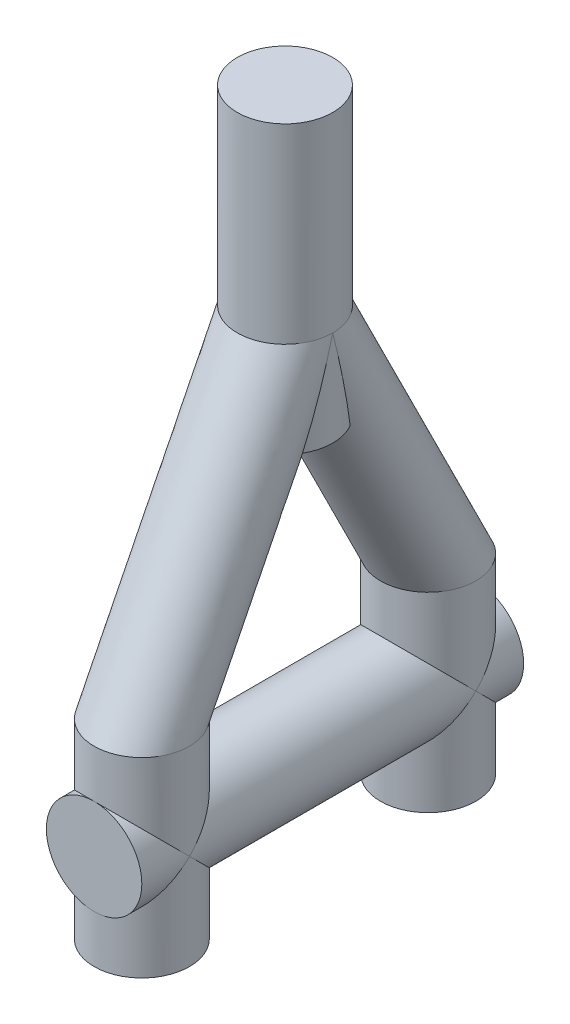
ISO-10303-21;
HEADER;
FILE_DESCRIPTION(('STEP AP214'),'2;1');
FILE_NAME('part.step','',(''),(''),'','','');
FILE_SCHEMA(('AUTOMOTIVE_DESIGN { 1 0 10303 214 1 1 1 1 }'));
ENDSEC;
DATA;
#1=APPLICATION_CONTEXT('core data for automotive mechanical design processes');
#2=APPLICATION_PROTOCOL_DEFINITION('international standard','automotive_design',2000,#1);
#3=PRODUCT_CONTEXT('',#1,'mechanical');
#4=PRODUCT('Part','Part','',(#3));
#5=PRODUCT_RELATED_PRODUCT_CATEGORY('part','',(#4));
#6=PRODUCT_DEFINITION_FORMATION('','',#4);
#7=PRODUCT_DEFINITION_CONTEXT('part definition',#1,'design');
#8=PRODUCT_DEFINITION('design','',#6,#7);
#9=PRODUCT_DEFINITION_SHAPE('','',#8);
#10=(LENGTH_UNIT() NAMED_UNIT(*) SI_UNIT(.MILLI.,.METRE.));
#11=(NAMED_UNIT(*) PLANE_ANGLE_UNIT() SI_UNIT($,.RADIAN.));
#12=(NAMED_UNIT(*) SI_UNIT($,.STERADIAN.) SOLID_ANGLE_UNIT());
#13=UNCERTAINTY_MEASURE_WITH_UNIT(LENGTH_MEASURE(1.E-05),#10,'distance_accuracy_value','');
#14=(GEOMETRIC_REPRESENTATION_CONTEXT(3) GLOBAL_UNCERTAINTY_ASSIGNED_CONTEXT((#13)) GLOBAL_UNIT_ASSIGNED_CONTEXT((#10,
#11,#12)) REPRESENTATION_CONTEXT('',''));
#15=CARTESIAN_POINT('',(0.,0.,0.));
#16=DIRECTION('',(0.,0.,1.));
#17=DIRECTION('',(1.,0.,0.));
#18=AXIS2_PLACEMENT_3D('',#15,#16,#17);
#19=CARTESIAN_POINT('',(0.,25.,0.));
#20=CARTESIAN_POINT('',(0.127464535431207,25.,0.));
#21=CARTESIAN_POINT('',(0.250995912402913,24.9806653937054,0.));
#22=CARTESIAN_POINT('',(0.49125169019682,24.9085344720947,0.));
#23=CARTESIAN_POINT('',(0.608012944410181,24.8550984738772,0.));
#24=CARTESIAN_POINT('',(0.823750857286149,24.7261441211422,0.));
#25=CARTESIAN_POINT('',(0.925420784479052,24.6493801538,0.));
#26=CARTESIAN_POINT('',(1.11332812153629,24.4815569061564,0.));
#27=CARTESIAN_POINT('',(1.19953239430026,24.3908446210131,0.));
#28=CARTESIAN_POINT('',(1.44068770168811,24.1033875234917,0.));
#29=CARTESIAN_POINT('',(1.57892280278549,23.8902558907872,0.));
#30=CARTESIAN_POINT('',(1.81791975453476,23.4477167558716,0.));
#31=CARTESIAN_POINT('',(1.91977295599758,23.2162558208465,-2.21603957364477E-13));
#32=CARTESIAN_POINT('',(2.18259516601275,22.5081408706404,-2.21691853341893E-13));
#33=CARTESIAN_POINT('',(2.30269212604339,22.0157411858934,0.));
#34=CARTESIAN_POINT('',(2.46126859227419,21.0204921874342,0.));
#35=CARTESIAN_POINT('',(2.49937546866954,20.5162492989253,0.));
#36=CARTESIAN_POINT('',(2.50060954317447,19.5082359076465,0.));
#37=CARTESIAN_POINT('',(2.46375913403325,19.0040649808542,0.));
#38=CARTESIAN_POINT('',(2.30783767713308,18.0080502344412,0.));
#39=CARTESIAN_POINT('',(2.18947252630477,17.5161359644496,0.));
#40=CARTESIAN_POINT('',(1.92901754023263,16.8059820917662,0.));
#41=CARTESIAN_POINT('',(1.82870401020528,16.5751839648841,1.70467404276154E-12));
#42=CARTESIAN_POINT('',(1.59119778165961,16.1298117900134,1.70461876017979E-12));
#43=CARTESIAN_POINT('',(1.45444285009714,15.9161335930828,8.75945365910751E-13));
#44=CARTESIAN_POINT('',(1.13483555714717,15.5291864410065,8.75897335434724E-13));
#45=CARTESIAN_POINT('',(0.954942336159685,15.3570497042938,0.));
#46=CARTESIAN_POINT('',(0.630813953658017,15.1565036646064,0.));
#47=CARTESIAN_POINT('',(0.516878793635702,15.1019713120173,0.));
#48=CARTESIAN_POINT('',(0.276366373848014,15.0246782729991,0.));
#49=CARTESIAN_POINT('',(0.149969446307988,15.002707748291,0.));
#50=CARTESIAN_POINT('',(-0.10080357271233,14.9977757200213,0.));
#51=CARTESIAN_POINT('',(-0.228798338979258,15.0149615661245,0.));
#52=CARTESIAN_POINT('',(-0.47133985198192,15.0835624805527,0.));
#53=CARTESIAN_POINT('',(-0.588825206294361,15.1353674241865,0.));
#54=CARTESIAN_POINT('',(-0.915734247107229,15.3254127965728,0.));
#55=CARTESIAN_POINT('',(-1.10426556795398,15.4981529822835,0.));
#56=CARTESIAN_POINT('',(-1.43158155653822,15.8833832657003,0.));
#57=CARTESIAN_POINT('',(-1.57079702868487,16.0964152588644,2.14927187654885E-13));
#58=CARTESIAN_POINT('',(-1.81231665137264,16.5402860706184,2.14982283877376E-13));
#59=CARTESIAN_POINT('',(-1.91507992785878,16.7724166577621,0.));
#60=CARTESIAN_POINT('',(-2.18034927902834,17.4832594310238,0.));
#61=CARTESIAN_POINT('',(-2.30138010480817,17.9780309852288,0.));
#62=CARTESIAN_POINT('',(-2.46081940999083,18.9747041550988,0.));
#63=CARTESIAN_POINT('',(-2.49930566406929,19.4804284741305,0.));
#64=CARTESIAN_POINT('',(-2.50067600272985,20.4924915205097,0.));
#65=CARTESIAN_POINT('',(-2.4635422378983,20.9987196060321,0.));
#66=CARTESIAN_POINT('',(-2.30685451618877,21.9968202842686,0.));
#67=CARTESIAN_POINT('',(-2.187596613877,22.4911074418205,0.));
#68=CARTESIAN_POINT('',(-1.92517094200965,23.2034123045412,0.));
#69=CARTESIAN_POINT('',(-1.82342162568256,23.4361193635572,-1.67059156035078E-13));
#70=CARTESIAN_POINT('',(-1.58477214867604,23.8807693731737,-1.67003963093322E-13));
#71=CARTESIAN_POINT('',(-1.44894335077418,24.0919463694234,0.));
#72=CARTESIAN_POINT('',(-1.12619452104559,24.4797897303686,0.));
#73=CARTESIAN_POINT('',(-0.939830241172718,24.6556292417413,0.));
#74=CARTESIAN_POINT('',(-0.612326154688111,24.8530638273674,0.));
#75=CARTESIAN_POINT('',(-0.497446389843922,24.9061294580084,0.));
#76=CARTESIAN_POINT('',(-0.255456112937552,24.9798480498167,0.));
#77=CARTESIAN_POINT('',(-0.127464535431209,25.,0.));
#78=CARTESIAN_POINT('',(0.,25.,0.));
#79=B_SPLINE_CURVE_WITH_KNOTS('',3,(#19,#20,#21,#22,#23,#24,#25,#26,#27,#28,#29,#30,#31,#32,#33,
#34,#35,#36,#37,#38,#39,#40,#41,#42,#43,#44,#45,#46,#47,#48,#49,#50,#51,#52,#53,#54,#55,#56,#57,
#58,#59,#60,#61,#62,#63,#64,#65,#66,#67,#68,#69,#70,#71,#72,#73,#74,#75,#76,#77,#78),
.UNSPECIFIED.,.T.,.F.,(4,2,2,2,2,2,2,2,2,2,2,2,2,2,2,2,2,2,2,2,2,2,2,2,2,2,2,2,2,4),(0.,
0.0156249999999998,0.0312499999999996,0.0468749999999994,0.0624999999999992,0.0937499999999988,
0.124999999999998,0.187499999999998,0.249999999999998,0.312499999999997,0.374999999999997,
0.406249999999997,0.437499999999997,0.468749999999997,0.484374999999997,0.499999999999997,
0.515624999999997,0.531249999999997,0.562499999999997,0.593749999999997,0.624999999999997,
0.687499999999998,0.749999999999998,0.812499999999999,0.874999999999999,0.906249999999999,
0.9375,0.96875,0.984375,1.),.UNSPECIFIED.);
#80=DIRECTION('',(0.,-0.894427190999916,-0.447213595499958));
#81=VECTOR('',#80,1.);
#82=SURFACE_OF_LINEAR_EXTRUSION('',#79,#81);
#83=CARTESIAN_POINT('',(2.3857984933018,5.00000000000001,-6.753029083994));
#84=CARTESIAN_POINT('',(2.39326999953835,4.99998927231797,-6.77689887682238));
#85=CARTESIAN_POINT('',(2.40038230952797,4.99992576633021,-6.80088095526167));
#86=CARTESIAN_POINT('',(2.41505647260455,4.99972456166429,-6.85322689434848));
#87=CARTESIAN_POINT('',(2.42248215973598,4.99957590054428,-6.88162895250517));
#88=CARTESIAN_POINT('',(2.43733830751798,4.99925335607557,-6.9428156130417));
#89=CARTESIAN_POINT('',(2.44461308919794,4.99907894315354,-6.9756380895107));
#90=CARTESIAN_POINT('',(2.45865759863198,4.99870552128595,-7.04566914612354));
#91=CARTESIAN_POINT('',(2.46525057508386,4.99850616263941,-7.0829132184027));
#92=CARTESIAN_POINT('',(2.47758578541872,4.99819084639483,-7.16316234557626));
#93=CARTESIAN_POINT('',(2.4830602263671,4.99809147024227,-7.20620896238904));
#94=CARTESIAN_POINT('',(2.49097434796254,4.99813218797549,-7.28474006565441));
#95=CARTESIAN_POINT('',(2.49378333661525,4.99823231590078,-7.32018785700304));
#96=CARTESIAN_POINT('',(2.49744254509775,4.99853926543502,-7.38350584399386));
#97=CARTESIAN_POINT('',(2.49858475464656,4.99871837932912,-7.41135944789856));
#98=CARTESIAN_POINT('',(2.49975363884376,4.99920406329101,-7.45947886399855));
#99=CARTESIAN_POINT('',(2.49999974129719,4.99946248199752,-7.47974001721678));
#100=CARTESIAN_POINT('',(2.5000001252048,4.99979711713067,-7.50000001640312));
#101=B_SPLINE_CURVE_WITH_KNOTS('',3,(#83,#84,#85,#86,#87,#88,#89,#90,#91,#92,#93,#94,#95,#96,
#97,#98,#99,#100),.UNSPECIFIED.,.F.,.F.,(4,2,2,2,2,2,2,2,4),(0.,0.0750325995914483,
0.163085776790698,0.263916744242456,0.377349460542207,0.507467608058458,0.614112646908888,
0.697729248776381,0.758516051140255),.UNSPECIFIED.);
#102=CARTESIAN_POINT('',(2.49995729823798,4.99981526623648,-7.48980453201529));
#103=VERTEX_POINT('',#102);
#104=CARTESIAN_POINT('',(2.38579853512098,5.,-6.75302921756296));
#105=VERTEX_POINT('',#104);
#106=EDGE_CURVE('E291',#103,#105,#101,.F.);
#107=ORIENTED_EDGE('',*,*,#106,.F.);
#108=CARTESIAN_POINT('',(2.50000012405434,5.00000000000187,-7.49997500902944));
#109=CARTESIAN_POINT('',(2.50000099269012,4.99999925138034,-7.53625989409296));
#110=CARTESIAN_POINT('',(2.49922135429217,5.00006416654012,-7.57254551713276));
#111=CARTESIAN_POINT('',(2.49612662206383,5.00029188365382,-7.64409575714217));
#112=CARTESIAN_POINT('',(2.49385239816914,5.00045206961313,-7.67936215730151));
#113=CARTESIAN_POINT('',(2.48787138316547,5.00083513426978,-7.74887274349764));
#114=CARTESIAN_POINT('',(2.48420235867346,5.00105632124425,-7.78312018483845));
#115=CARTESIAN_POINT('',(2.47553729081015,5.00153233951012,-7.85059139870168));
#116=CARTESIAN_POINT('',(2.47057605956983,5.00178621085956,-7.88381965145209));
#117=CARTESIAN_POINT('',(2.45943077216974,5.00230429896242,-7.94925144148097));
#118=CARTESIAN_POINT('',(2.45327885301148,5.00256812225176,-7.98146045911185));
#119=CARTESIAN_POINT('',(2.43985578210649,5.00308737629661,-8.04485292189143));
#120=CARTESIAN_POINT('',(2.43261436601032,5.00334285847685,-8.07604266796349));
#121=CARTESIAN_POINT('',(2.41711470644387,5.00383377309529,-8.13739590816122));
#122=CARTESIAN_POINT('',(2.40888408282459,5.00406953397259,-8.1675663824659));
#123=CARTESIAN_POINT('',(2.39150754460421,5.00450545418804,-8.22688048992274));
#124=CARTESIAN_POINT('',(2.38238740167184,5.00470631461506,-8.25603167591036));
#125=CARTESIAN_POINT('',(2.36333206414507,5.00510184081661,-8.31330876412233));
#126=CARTESIAN_POINT('',(2.35342097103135,5.00529654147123,-8.34144268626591));
#127=CARTESIAN_POINT('',(2.33284949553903,5.00565153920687,-8.39668281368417));
#128=CARTESIAN_POINT('',(2.3222122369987,5.0058125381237,-8.42379762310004));
#129=CARTESIAN_POINT('',(2.30026194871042,5.0060805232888,-8.47699917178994));
#130=CARTESIAN_POINT('',(2.28897101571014,5.00618870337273,-8.50309502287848));
#131=CARTESIAN_POINT('',(2.26578959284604,5.00633872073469,-8.55425812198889));
#132=CARTESIAN_POINT('',(2.25392028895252,5.00638210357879,-8.57933496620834));
#133=CARTESIAN_POINT('',(2.22966158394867,5.00639683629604,-8.62845966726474));
#134=CARTESIAN_POINT('',(2.21729255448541,5.00636995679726,-8.6525175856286));
#135=CARTESIAN_POINT('',(2.19211606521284,5.00624468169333,-8.69960389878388));
#136=CARTESIAN_POINT('',(2.17932826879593,5.00614815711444,-8.72264281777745));
#137=CARTESIAN_POINT('',(2.15339791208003,5.00588864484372,-8.76769121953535));
#138=CARTESIAN_POINT('',(2.14027439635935,5.00572753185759,-8.78971167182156));
#139=CARTESIAN_POINT('',(2.11375652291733,5.00535151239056,-8.83272108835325));
#140=CARTESIAN_POINT('',(2.1003807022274,5.00513827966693,-8.8537215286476));
#141=CARTESIAN_POINT('',(2.06062213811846,5.00443891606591,-8.91420504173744));
#142=CARTESIAN_POINT('',(2.03344818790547,5.00388070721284,-8.9531715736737));
#143=CARTESIAN_POINT('',(1.97891933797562,5.00280404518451,-9.02692731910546));
#144=CARTESIAN_POINT('',(1.9517039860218,5.00228548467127,-9.06181994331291));
#145=CARTESIAN_POINT('',(1.89774618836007,5.00132428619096,-9.12732884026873));
#146=CARTESIAN_POINT('',(1.87114578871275,5.00087890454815,-9.15806193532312));
#147=CARTESIAN_POINT('',(1.81896318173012,5.00026062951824,-9.21534818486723));
#148=CARTESIAN_POINT('',(1.79351631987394,5.00006624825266,-9.24202427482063));
#149=CARTESIAN_POINT('',(1.74699731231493,4.99995562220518,-9.28856183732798));
#150=CARTESIAN_POINT('',(1.72615839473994,4.99998863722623,-9.30865711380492));
#151=CARTESIAN_POINT('',(1.6839754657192,5.00008821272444,-9.34794099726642));
#152=CARTESIAN_POINT('',(1.66263732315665,5.00015448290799,-9.36713590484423));
#153=CARTESIAN_POINT('',(1.61946161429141,5.00039060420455,-9.40459894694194));
#154=CARTESIAN_POINT('',(1.59762941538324,5.00055962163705,-9.4228732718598));
#155=CARTESIAN_POINT('',(1.5535431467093,5.00088918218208,-9.4585058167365));
#156=CARTESIAN_POINT('',(1.53129439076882,5.00104978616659,-9.47587061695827));
#157=CARTESIAN_POINT('',(1.48650833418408,5.00132477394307,-9.50963189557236));
#158=CARTESIAN_POINT('',(1.46397811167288,5.00143971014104,-9.52603776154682));
#159=CARTESIAN_POINT('',(1.41864036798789,5.00159260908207,-9.5579357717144));
#160=CARTESIAN_POINT('',(1.39583841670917,5.00163138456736,-9.57343583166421));
#161=CARTESIAN_POINT('',(1.3500322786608,5.00162126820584,-9.60352066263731));
#162=CARTESIAN_POINT('',(1.32703386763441,5.00157343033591,-9.61811423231));
#163=CARTESIAN_POINT('',(1.28090635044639,5.00139687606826,-9.64639186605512));
#164=CARTESIAN_POINT('',(1.25778309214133,5.00126924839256,-9.66008547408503));
#165=CARTESIAN_POINT('',(1.2115215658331,5.00100089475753,-9.68649700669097));
#166=CARTESIAN_POINT('',(1.18839066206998,5.00086043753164,-9.69922782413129));
#167=CARTESIAN_POINT('',(1.14204475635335,5.00058016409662,-9.72378146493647));
#168=CARTESIAN_POINT('',(1.11883495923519,5.00044036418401,-9.73561410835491));
#169=CARTESIAN_POINT('',(1.07237296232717,5.00021364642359,-9.75836804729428));
#170=CARTESIAN_POINT('',(1.04912586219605,5.00012601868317,-9.76929974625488));
#171=CARTESIAN_POINT('',(1.00266051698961,5.00000959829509,-9.79025696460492));
#172=CARTESIAN_POINT('',(0.979447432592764,4.99997991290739,-9.80029392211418));
#173=CARTESIAN_POINT('',(0.930372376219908,5.00001805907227,-9.82058276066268));
#174=CARTESIAN_POINT('',(0.904477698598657,5.00009594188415,-9.83075571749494));
#175=CARTESIAN_POINT('',(0.85227493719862,5.00037996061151,-9.85020359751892));
#176=CARTESIAN_POINT('',(0.825965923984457,5.00058644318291,-9.8594760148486));
#177=CARTESIAN_POINT('',(0.7730465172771,5.00098434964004,-9.87714632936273));
#178=CARTESIAN_POINT('',(0.746436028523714,5.00117576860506,-9.88554394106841));
#179=CARTESIAN_POINT('',(0.692874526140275,5.00156256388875,-9.90144617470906));
#180=CARTESIAN_POINT('',(0.665922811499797,5.00175794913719,-9.90894843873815));
#181=CARTESIAN_POINT('',(0.611816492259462,5.00216487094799,-9.92302595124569));
#182=CARTESIAN_POINT('',(0.584662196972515,5.00237638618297,-9.92960239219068));
#183=CARTESIAN_POINT('',(0.530239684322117,5.00271192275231,-9.94187880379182));
#184=CARTESIAN_POINT('',(0.502972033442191,5.00283619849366,-9.94758128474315));
#185=CARTESIAN_POINT('',(0.448502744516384,5.00294849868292,-9.9580996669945));
#186=CARTESIAN_POINT('',(0.421302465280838,5.00293765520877,-9.96292259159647));
#187=CARTESIAN_POINT('',(0.367122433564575,5.00273826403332,-9.97168163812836));
#188=CARTESIAN_POINT('',(0.340144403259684,5.00255202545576,-9.97562846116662));
#189=CARTESIAN_POINT('',(0.286620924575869,5.00211188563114,-9.98260892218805));
#190=CARTESIAN_POINT('',(0.260077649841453,5.00185941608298,-9.98565928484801));
#191=CARTESIAN_POINT('',(0.207278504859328,5.00133966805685,-9.99087689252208));
#192=CARTESIAN_POINT('',(0.181023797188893,5.00107264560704,-9.99305587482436));
#193=CARTESIAN_POINT('',(0.128815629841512,5.0005925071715,-9.99652999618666));
#194=CARTESIAN_POINT('',(0.102862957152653,5.00037870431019,-9.9978368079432));
#195=CARTESIAN_POINT('',(0.0512731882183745,5.0000792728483,-9.99957037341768));
#196=CARTESIAN_POINT('',(0.0256364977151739,4.99999197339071,-10.0000086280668));
#197=CARTESIAN_POINT('',(-0.0257921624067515,5.000008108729,-9.99999130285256));
#198=CARTESIAN_POINT('',(-0.0515841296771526,5.000112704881,-9.99953027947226));
#199=CARTESIAN_POINT('',(-0.103768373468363,5.00042282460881,-9.99773647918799));
#200=CARTESIAN_POINT('',(-0.130159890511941,5.0006307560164,-9.99638263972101));
#201=CARTESIAN_POINT('',(-0.183397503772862,5.00108600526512,-9.99280226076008));
#202=CARTESIAN_POINT('',(-0.210242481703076,5.00133400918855,-9.99055929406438));
#203=CARTESIAN_POINT('',(-0.264218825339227,5.00181300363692,-9.98519654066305));
#204=CARTESIAN_POINT('',(-0.291349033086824,5.00204371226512,-9.98206508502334));
#205=CARTESIAN_POINT('',(-0.34554825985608,5.002423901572,-9.97493641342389));
#206=CARTESIAN_POINT('',(-0.372617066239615,5.00257322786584,-9.97093757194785));
#207=CARTESIAN_POINT('',(-0.426765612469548,5.00280404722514,-9.96206011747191));
#208=CARTESIAN_POINT('',(-0.453844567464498,5.00288515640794,-9.95717671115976));
#209=CARTESIAN_POINT('',(-0.507991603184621,5.00295176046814,-9.94653405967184));
#210=CARTESIAN_POINT('',(-0.53505872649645,5.00293670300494,-9.94076994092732));
#211=CARTESIAN_POINT('',(-0.589147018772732,5.00279685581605,-9.9283606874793));
#212=CARTESIAN_POINT('',(-0.616167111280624,5.00267146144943,-9.92171086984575));
#213=CARTESIAN_POINT('',(-0.67001216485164,5.00226262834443,-9.90757575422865));
#214=CARTESIAN_POINT('',(-0.696836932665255,5.00197905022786,-9.90008972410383));
#215=CARTESIAN_POINT('',(-0.750231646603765,5.00139271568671,-9.88424497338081));
#216=CARTESIAN_POINT('',(-0.776801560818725,5.00108995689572,-9.87588614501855));
#217=CARTESIAN_POINT('',(-0.829517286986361,5.00059262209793,-9.85828244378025));
#218=CARTESIAN_POINT('',(-0.855664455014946,5.00039757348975,-9.84904165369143));
#219=CARTESIAN_POINT('',(-0.907500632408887,5.00013689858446,-9.82967492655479));
#220=CARTESIAN_POINT('',(-0.933191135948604,5.00007071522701,-9.81955299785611));
#221=CARTESIAN_POINT('',(-0.9822360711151,5.00002565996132,-9.79923202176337));
#222=CARTESIAN_POINT('',(-1.00561794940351,5.00004045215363,-9.78909903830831));
#223=CARTESIAN_POINT('',(-1.0524969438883,5.00002610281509,-9.76793563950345));
#224=CARTESIAN_POINT('',(-1.07598809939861,4.99999613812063,-9.75689202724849));
#225=CARTESIAN_POINT('',(-1.12299718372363,4.99990517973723,-9.73389604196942));
#226=CARTESIAN_POINT('',(-1.14650929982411,4.9998436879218,-9.72193178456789));
#227=CARTESIAN_POINT('',(-1.19347964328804,4.99969601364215,-9.69709519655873));
#228=CARTESIAN_POINT('',(-1.21693229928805,4.99960949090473,-9.68421233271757));
#229=CARTESIAN_POINT('',(-1.26360242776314,4.99945337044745,-9.65759786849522));
#230=CARTESIAN_POINT('',(-1.28681647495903,4.99938391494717,-9.64386025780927));
#231=CARTESIAN_POINT('',(-1.33302636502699,4.99933226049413,-9.6154794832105));
#232=CARTESIAN_POINT('',(-1.35601723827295,4.99935100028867,-9.6008282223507));
#233=CARTESIAN_POINT('',(-1.40172068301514,4.99942999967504,-9.57062132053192));
#234=CARTESIAN_POINT('',(-1.42442833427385,4.99949066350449,-9.55505823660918));
#235=CARTESIAN_POINT('',(-1.46951926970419,4.9996250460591,-9.52302718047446));
#236=CARTESIAN_POINT('',(-1.49189747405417,4.99969888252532,-9.50655205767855));
#237=CARTESIAN_POINT('',(-1.53622812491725,4.99983476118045,-9.47274695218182));
#238=CARTESIAN_POINT('',(-1.55817687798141,4.99989672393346,-9.45541212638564));
#239=CARTESIAN_POINT('',(-1.60169115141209,4.99999223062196,-9.41984173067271));
#240=CARTESIAN_POINT('',(-1.62325082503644,5.000025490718,-9.40159900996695));
#241=CARTESIAN_POINT('',(-1.66597845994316,5.00005768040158,-9.36421703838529));
#242=CARTESIAN_POINT('',(-1.68713995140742,5.00005624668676,-9.34507039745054));
#243=CARTESIAN_POINT('',(-1.72903287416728,5.00001177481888,-9.30589055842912));
#244=CARTESIAN_POINT('',(-1.7497577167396,4.99996831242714,-9.28585030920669));
#245=CARTESIAN_POINT('',(-1.79641037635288,5.00004982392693,-9.23905619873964));
#246=CARTESIAN_POINT('',(-1.82208818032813,5.00022774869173,-9.21205226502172));
#247=CARTESIAN_POINT('',(-1.87471003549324,5.00077502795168,-9.15409183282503));
#248=CARTESIAN_POINT('',(-1.90151821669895,5.00116197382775,-9.123012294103));
#249=CARTESIAN_POINT('',(-1.95568971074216,5.00195857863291,-9.05699791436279));
#250=CARTESIAN_POINT('',(-1.98292119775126,5.0023675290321,-9.02195498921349));
#251=CARTESIAN_POINT('',(-2.0374339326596,5.00321390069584,-8.94792314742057));
#252=CARTESIAN_POINT('',(-2.06457673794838,5.00365124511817,-8.90883202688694));
#253=CARTESIAN_POINT('',(-2.10425700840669,5.00421110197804,-8.84816731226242));
#254=CARTESIAN_POINT('',(-2.11759587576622,5.00438437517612,-8.82711394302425));
#255=CARTESIAN_POINT('',(-2.14402748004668,5.00469040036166,-8.78400521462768));
#256=CARTESIAN_POINT('',(-2.15710179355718,5.00482182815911,-8.76193851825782));
#257=CARTESIAN_POINT('',(-2.18292209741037,5.0050344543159,-8.71680403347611));
#258=CARTESIAN_POINT('',(-2.19564914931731,5.00511417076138,-8.69372540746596));
#259=CARTESIAN_POINT('',(-2.22069369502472,5.00521889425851,-8.64656613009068));
#260=CARTESIAN_POINT('',(-2.23299163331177,5.00524240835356,-8.62247508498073));
#261=CARTESIAN_POINT('',(-2.2570989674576,5.0052349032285,-8.57329057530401));
#262=CARTESIAN_POINT('',(-2.268888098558,5.00520248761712,-8.54818717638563));
#263=CARTESIAN_POINT('',(-2.29190142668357,5.00508885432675,-8.49697741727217));
#264=CARTESIAN_POINT('',(-2.30310454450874,5.00500645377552,-8.47086158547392));
#265=CARTESIAN_POINT('',(-2.32487311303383,5.00480483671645,-8.41762654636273));
#266=CARTESIAN_POINT('',(-2.33541657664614,5.00468477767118,-8.39049835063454));
#267=CARTESIAN_POINT('',(-2.35579597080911,5.004426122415,-8.33523786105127));
#268=CARTESIAN_POINT('',(-2.36560888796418,5.00428715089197,-8.30709708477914));
#269=CARTESIAN_POINT('',(-2.38446614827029,5.0040183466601,-8.24981268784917));
#270=CARTESIAN_POINT('',(-2.39348651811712,5.00388881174,-8.22066117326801));
#271=CARTESIAN_POINT('',(-2.41066640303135,5.00358024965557,-8.16135313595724));
#272=CARTESIAN_POINT('',(-2.41880033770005,5.00340011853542,-8.13118920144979));
#273=CARTESIAN_POINT('',(-2.4341088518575,5.00301030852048,-8.06985543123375));
#274=CARTESIAN_POINT('',(-2.44125598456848,5.00280002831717,-8.03867874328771));
#275=CARTESIAN_POINT('',(-2.45449303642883,5.00236023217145,-7.9753188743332));
#276=CARTESIAN_POINT('',(-2.46055340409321,5.00213037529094,-7.94312951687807));
#277=CARTESIAN_POINT('',(-2.47151792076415,5.0016704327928,-7.87774350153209));
#278=CARTESIAN_POINT('',(-2.47639011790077,5.00144047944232,-7.84454148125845));
#279=CARTESIAN_POINT('',(-2.48487909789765,5.0010034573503,-7.77712919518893));
#280=CARTESIAN_POINT('',(-2.48846125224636,5.00079710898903,-7.74291456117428));
#281=CARTESIAN_POINT('',(-2.49426989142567,5.00043622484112,-7.67347603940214));
#282=CARTESIAN_POINT('',(-2.4964587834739,5.00028317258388,-7.63824900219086));
#283=CARTESIAN_POINT('',(-2.49938331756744,5.00006387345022,-7.56678396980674));
#284=CARTESIAN_POINT('',(-2.50007824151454,5.00000007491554,-7.53054429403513));
#285=CARTESIAN_POINT('',(-2.49999352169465,4.99999999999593,-7.49430708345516));
#286=B_SPLINE_CURVE_WITH_KNOTS('',3,(#108,#109,#110,#111,#112,#113,#114,#115,#116,#117,#118,
#119,#120,#121,#122,#123,#124,#125,#126,#127,#128,#129,#130,#131,#132,#133,#134,#135,#136,#137,
#138,#139,#140,#141,#142,#143,#144,#145,#146,#147,#148,#149,#150,#151,#152,#153,#154,#155,#156,
#157,#158,#159,#160,#161,#162,#163,#164,#165,#166,#167,#168,#169,#170,#171,#172,#173,#174,#175,
#176,#177,#178,#179,#180,#181,#182,#183,#184,#185,#186,#187,#188,#189,#190,#191,#192,#193,#194,
#195,#196,#197,#198,#199,#200,#201,#202,#203,#204,#205,#206,#207,#208,#209,#210,#211,#212,#213,
#214,#215,#216,#217,#218,#219,#220,#221,#222,#223,#224,#225,#226,#227,#228,#229,#230,#231,#232,
#233,#234,#235,#236,#237,#238,#239,#240,#241,#242,#243,#244,#245,#246,#247,#248,#249,#250,#251,
#252,#253,#254,#255,#256,#257,#258,#259,#260,#261,#262,#263,#264,#265,#266,#267,#268,#269,#270,
#271,#272,#273,#274,#275,#276,#277,#278,#279,#280,#281,#282,#283,#284,#285),.UNSPECIFIED.,.F.,
.F.,(4,2,2,2,2,2,2,2,2,2,2,2,2,2,2,2,2,2,2,2,2,2,2,2,2,2,2,2,2,2,2,2,2,2,2,2,2,2,2,2,2,2,2,2,2,
2,2,2,2,2,2,2,2,2,2,2,2,2,2,2,2,2,2,2,2,2,2,2,2,2,2,2,2,2,2,2,2,2,2,2,2,2,2,2,2,2,2,2,4),(0.,
0.108847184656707,0.214835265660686,0.318137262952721,0.41890165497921,0.517252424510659,
0.613289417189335,0.707088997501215,0.798704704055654,0.888173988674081,0.975537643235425,
1.06082292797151,1.14403952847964,1.2251793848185,1.30421690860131,1.38110957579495,
1.45579886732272,1.59824770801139,1.73095173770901,1.85284652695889,1.96340601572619,
2.05023717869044,2.13632322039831,2.22171992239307,2.30637462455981,2.38997164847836,
2.47267162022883,2.55437199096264,2.6349811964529,2.71417777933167,2.79232164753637,
2.86937637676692,2.94523421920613,3.02867983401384,3.11235136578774,3.19605011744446,
3.27996464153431,3.36377007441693,3.44733008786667,3.53019047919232,3.61197501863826,
3.6921195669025,3.77114495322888,3.84909027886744,3.92599641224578,4.00336951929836,
4.08263656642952,4.16344200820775,4.24536216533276,4.32743719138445,4.40997105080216,
4.49297937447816,4.57644543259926,4.65998515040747,4.74353519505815,4.8267156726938,
4.90953577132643,4.98597300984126,5.06383349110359,5.14296391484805,5.22322511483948,
5.30413402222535,5.38590605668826,5.46847775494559,5.55182829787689,5.6357183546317,
5.72042879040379,5.80602666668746,5.89249768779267,6.00424577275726,6.12733217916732,
6.26041787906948,6.40311517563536,6.4778780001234,6.55481390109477,6.63386716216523,
6.71499812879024,6.79818410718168,6.88341991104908,6.97071802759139,7.06010838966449,
7.15163511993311,7.2453389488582,7.34127339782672,7.43951449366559,7.5401616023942,
7.64333817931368,7.74919225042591,7.85789661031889),.UNSPECIFIED.);
#287=CARTESIAN_POINT('',(-2.49999317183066,4.99886097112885,-7.49629884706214));
#288=VERTEX_POINT('',#287);
#289=EDGE_CURVE('E312',#103,#288,#286,.T.);
#290=ORIENTED_EDGE('',*,*,#289,.T.);
#291=CARTESIAN_POINT('',(-2.49997412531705,4.99999996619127,-7.48861111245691));
#292=CARTESIAN_POINT('',(-2.49989660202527,4.99973519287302,-7.47168897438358));
#293=CARTESIAN_POINT('',(-2.49964788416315,4.99952380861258,-7.45476678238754));
#294=CARTESIAN_POINT('',(-2.49856268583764,4.9990749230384,-7.41106965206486));
#295=CARTESIAN_POINT('',(-2.49746813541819,4.99889399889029,-7.38430026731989));
#296=CARTESIAN_POINT('',(-2.49385238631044,4.99853973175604,-7.32089013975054));
#297=CARTESIAN_POINT('',(-2.49095262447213,4.99839408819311,-7.28427057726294));
#298=CARTESIAN_POINT('',(-2.48251767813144,4.99825808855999,-7.20112305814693));
#299=CARTESIAN_POINT('',(-2.47647646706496,4.99832158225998,-7.15464536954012));
#300=CARTESIAN_POINT('',(-2.46328247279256,4.99859889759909,-7.07148375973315));
#301=CARTESIAN_POINT('',(-2.45660296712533,4.9987796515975,-7.03472363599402));
#302=CARTESIAN_POINT('',(-2.442345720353,4.99912268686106,-6.96517077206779));
#303=CARTESIAN_POINT('',(-2.43492286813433,4.99928502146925,-6.93234629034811));
#304=CARTESIAN_POINT('',(-2.41966508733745,4.99958972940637,-6.87066676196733));
#305=CARTESIAN_POINT('',(-2.41196851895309,4.99973230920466,-6.84177741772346));
#306=CARTESIAN_POINT('',(-2.3965955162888,4.99992835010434,-6.78796870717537));
#307=CARTESIAN_POINT('',(-2.38904237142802,4.9999908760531,-6.76301409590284));
#308=CARTESIAN_POINT('',(-2.38109978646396,4.99999999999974,-6.73818387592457));
#309=B_SPLINE_CURVE_WITH_KNOTS('',3,(#291,#292,#293,#294,#295,#296,#297,#298,#299,#300,#301,
#302,#303,#304,#305,#306,#307,#308),.UNSPECIFIED.,.F.,.F.,(4,2,2,2,2,2,2,2,4),(0.,
0.0507724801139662,0.131135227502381,0.241303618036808,0.381829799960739,0.493881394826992,
0.594814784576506,0.684487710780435,0.762693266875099),.UNSPECIFIED.);
#310=CARTESIAN_POINT('',(-2.38109979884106,5.,-6.73818391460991));
#311=VERTEX_POINT('',#310);
#312=EDGE_CURVE('E239',#311,#288,#309,.F.);
#313=ORIENTED_EDGE('',*,*,#312,.F.);
#314=CARTESIAN_POINT('',(-2.38109978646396,4.99999999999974,-6.73818387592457));
#315=CARTESIAN_POINT('',(-2.36900757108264,4.99999696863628,-6.70037752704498));
#316=CARTESIAN_POINT('',(-2.35602536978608,4.9999412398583,-6.66285504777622));
#317=CARTESIAN_POINT('',(-2.3287985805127,4.9997916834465,-6.58981937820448));
#318=CARTESIAN_POINT('',(-2.31461694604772,4.99969931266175,-6.55428270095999));
#319=CARTESIAN_POINT('',(-2.2851883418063,4.99953746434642,-6.48522138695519));
#320=CARTESIAN_POINT('',(-2.27000120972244,4.99946725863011,-6.45167125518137));
#321=CARTESIAN_POINT('',(-2.23877354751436,4.99937808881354,-6.38658447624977));
#322=CARTESIAN_POINT('',(-2.22278995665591,4.99935722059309,-6.35502050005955));
#323=CARTESIAN_POINT('',(-2.19018649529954,4.999372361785,-6.29390750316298));
#324=CARTESIAN_POINT('',(-2.1736211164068,4.99940603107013,-6.26432939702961));
#325=CARTESIAN_POINT('',(-2.14007484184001,4.99951453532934,-6.20718948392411));
#326=CARTESIAN_POINT('',(-2.1231463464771,4.99958744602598,-6.17959689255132));
#327=CARTESIAN_POINT('',(-2.0890955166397,4.99974405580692,-6.12642896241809));
#328=CARTESIAN_POINT('',(-2.07202378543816,4.99982704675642,-6.10082119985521));
#329=CARTESIAN_POINT('',(-2.03790479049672,4.99995157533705,-6.05162484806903));
#330=CARTESIAN_POINT('',(-2.02090666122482,4.99999512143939,-6.02800217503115));
#331=CARTESIAN_POINT('',(-2.00350303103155,4.99999999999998,-6.00468210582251));
#332=B_SPLINE_CURVE_WITH_KNOTS('',3,(#314,#315,#316,#317,#318,#319,#320,#321,#322,#323,#324,
#325,#326,#327,#328,#329,#330,#331),.UNSPECIFIED.,.F.,.F.,(4,2,2,2,2,2,2,2,4),(0.,
0.119069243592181,0.233815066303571,0.344260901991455,0.450369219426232,0.552043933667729,
0.649134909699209,0.741444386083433,0.828735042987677),.UNSPECIFIED.);
#333=CARTESIAN_POINT('',(-2.00350271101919,5.,-6.00468167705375));
#334=VERTEX_POINT('',#333);
#335=EDGE_CURVE('E250',#334,#311,#332,.F.);
#336=ORIENTED_EDGE('',*,*,#335,.F.);
#337=CARTESIAN_POINT('',(-2.00350303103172,4.99999999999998,-6.00468210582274));
#338=CARTESIAN_POINT('',(-1.97750359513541,4.99998807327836,-5.96984103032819));
#339=CARTESIAN_POINT('',(-1.95059153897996,4.99995441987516,-5.93568144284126));
#340=CARTESIAN_POINT('',(-1.895848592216,4.99989409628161,-5.86980893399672));
#341=CARTESIAN_POINT('',(-1.86806890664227,4.99986724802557,-5.838053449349));
#342=CARTESIAN_POINT('',(-1.81186390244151,4.99986454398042,-5.77699489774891));
#343=CARTESIAN_POINT('',(-1.78348867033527,4.99988706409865,-5.74764570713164));
#344=CARTESIAN_POINT('',(-1.7263964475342,4.99995608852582,-5.6913973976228));
#345=CARTESIAN_POINT('',(-1.69772890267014,5.0000016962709,-5.66444806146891));
#346=CARTESIAN_POINT('',(-1.63638274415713,4.99997586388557,-5.60946609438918));
#347=CARTESIAN_POINT('',(-1.60358078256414,4.9998929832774,-5.58157086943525));
#348=CARTESIAN_POINT('',(-1.53736477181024,4.99978499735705,-5.52814380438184));
#349=CARTESIAN_POINT('',(-1.50398297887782,4.99975858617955,-5.50257194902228));
#350=CARTESIAN_POINT('',(-1.43688092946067,4.99978402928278,-5.45379550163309));
#351=CARTESIAN_POINT('',(-1.40319328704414,4.99983382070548,-5.43054603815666));
#352=CARTESIAN_POINT('',(-1.33578247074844,4.99993328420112,-5.3864216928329));
#353=CARTESIAN_POINT('',(-1.30209287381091,4.99998291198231,-5.36549549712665));
#354=CARTESIAN_POINT('',(-1.26792356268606,5.,-5.34538406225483));
#355=B_SPLINE_CURVE_WITH_KNOTS('',3,(#337,#338,#339,#340,#341,#342,#343,#344,#345,#346,#347,
#348,#349,#350,#351,#352,#353,#354),.UNSPECIFIED.,.F.,.F.,(4,2,2,2,2,2,2,2,4),(0.,
0.130402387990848,0.256922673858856,0.379343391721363,0.497338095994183,0.626457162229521,
0.752556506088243,0.875302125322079,0.994236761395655),.UNSPECIFIED.);
#356=CARTESIAN_POINT('',(-1.26792356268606,5.,-5.34538406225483));
#357=VERTEX_POINT('',#356);
#358=EDGE_CURVE('E260',#357,#334,#355,.F.);
#359=ORIENTED_EDGE('',*,*,#358,.F.);
#360=CARTESIAN_POINT('',(-1.26792356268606,5.,-5.34538406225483));
#361=CARTESIAN_POINT('',(-1.24505411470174,4.99999602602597,-5.33192692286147));
#362=CARTESIAN_POINT('',(-1.22196945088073,4.99997084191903,-5.31883595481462));
#363=CARTESIAN_POINT('',(-1.17569490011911,4.99990922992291,-5.29355874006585));
#364=CARTESIAN_POINT('',(-1.15251018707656,4.99987295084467,-5.28136302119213));
#365=CARTESIAN_POINT('',(-1.10611562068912,4.99981905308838,-5.25787659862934));
#366=CARTESIAN_POINT('',(-1.08291118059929,4.99980116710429,-5.24657520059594));
#367=CARTESIAN_POINT('',(-1.03655720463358,4.99978397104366,-5.22487925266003));
#368=CARTESIAN_POINT('',(-1.01341331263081,4.99978435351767,-5.21447264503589));
#369=CARTESIAN_POINT('',(-0.966060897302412,4.99978992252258,-5.19404800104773));
#370=CARTESIAN_POINT('',(-0.9418422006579,4.99979526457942,-5.18405354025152));
#371=CARTESIAN_POINT('',(-0.893268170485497,4.99982240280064,-5.16489474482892));
#372=CARTESIAN_POINT('',(-0.86891487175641,4.99984408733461,-5.15572524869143));
#373=CARTESIAN_POINT('',(-0.820127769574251,4.99989712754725,-5.13821730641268));
#374=CARTESIAN_POINT('',(-0.795696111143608,4.99992840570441,-5.12987288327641));
#375=CARTESIAN_POINT('',(-0.746809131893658,4.99997858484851,-5.11401657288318));
#376=CARTESIAN_POINT('',(-0.722356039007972,4.99999759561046,-5.10649781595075));
#377=CARTESIAN_POINT('',(-0.697792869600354,5.00000000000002,-5.0993573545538));
#378=B_SPLINE_CURVE_WITH_KNOTS('',3,(#360,#361,#362,#363,#364,#365,#366,#367,#368,#369,#370,
#371,#372,#373,#374,#375,#376,#377),.UNSPECIFIED.,.F.,.F.,(4,2,2,2,2,2,2,2,4),(0.,
0.0796012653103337,0.158178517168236,0.235596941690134,0.311712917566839,0.390299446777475,
0.468353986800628,0.545793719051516,0.622530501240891),.UNSPECIFIED.);
#379=CARTESIAN_POINT('',(-0.697792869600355,5.,-5.0993573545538));
#380=VERTEX_POINT('',#379);
#381=EDGE_CURVE('E270',#380,#357,#378,.F.);
#382=ORIENTED_EDGE('',*,*,#381,.F.);
#383=CARTESIAN_POINT('',(-0.697792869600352,5.,-5.09935735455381));
#384=CARTESIAN_POINT('',(-0.679779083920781,4.99999904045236,-5.09412244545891));
#385=CARTESIAN_POINT('',(-0.661705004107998,4.9999944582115,-5.0890958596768));
#386=CARTESIAN_POINT('',(-0.625542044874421,4.99998453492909,-5.07947825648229));
#387=CARTESIAN_POINT('',(-0.607453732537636,4.99997919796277,-5.07488510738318));
#388=CARTESIAN_POINT('',(-0.571326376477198,4.99997412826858,-5.06613431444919));
#389=CARTESIAN_POINT('',(-0.553288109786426,4.99997435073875,-5.06197346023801));
#390=CARTESIAN_POINT('',(-0.517318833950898,4.99997955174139,-5.05408877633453));
#391=CARTESIAN_POINT('',(-0.49938874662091,4.99998447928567,-5.05036074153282));
#392=CARTESIAN_POINT('',(-0.463688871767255,4.99999524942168,-5.04334210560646));
#393=CARTESIAN_POINT('',(-0.4459200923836,5.00000107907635,-5.04004637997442));
#394=CARTESIAN_POINT('',(-0.409992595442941,4.99999890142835,-5.0337910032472));
#395=CARTESIAN_POINT('',(-0.391832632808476,4.99999064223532,-5.03083849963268));
#396=CARTESIAN_POINT('',(-0.355438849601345,4.99998392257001,-5.02533541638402));
#397=CARTESIAN_POINT('',(-0.337204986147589,4.99998546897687,-5.02278512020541));
#398=CARTESIAN_POINT('',(-0.300618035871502,4.99998863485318,-5.01809176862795));
#399=CARTESIAN_POINT('',(-0.282264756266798,4.99999025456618,-5.01595021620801));
#400=CARTESIAN_POINT('',(-0.245493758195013,4.99999387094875,-5.01206935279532));
#401=CARTESIAN_POINT('',(-0.227075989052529,4.9999958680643,-5.01033052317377));
#402=CARTESIAN_POINT('',(-0.190239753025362,4.99999877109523,-5.00725765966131));
#403=CARTESIAN_POINT('',(-0.171821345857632,4.99999967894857,-5.00592291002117));
#404=CARTESIAN_POINT('',(-0.134994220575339,5.00000032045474,-5.00365524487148));
#405=CARTESIAN_POINT('',(-0.116585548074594,5.00000005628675,-5.00272158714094));
#406=CARTESIAN_POINT('',(-0.0798689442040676,4.99999965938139,-5.00126016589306));
#407=CARTESIAN_POINT('',(-0.0615611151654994,4.99999952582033,-5.00072986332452));
#408=CARTESIAN_POINT('',(-0.0341532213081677,5.00000014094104,-5.00023824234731));
#409=CARTESIAN_POINT('',(-0.0250556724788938,5.00000047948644,-5.00012488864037));
#410=CARTESIAN_POINT('',(-0.00683103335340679,4.9999995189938,-4.99999985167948));
#411=CARTESIAN_POINT('',(0.0022960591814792,4.99999821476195,-4.99998849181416));
#412=CARTESIAN_POINT('',(0.0297215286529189,4.99999582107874,-5.00010965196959));
#413=CARTESIAN_POINT('',(0.0480194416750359,4.99999626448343,-5.00039822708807));
#414=CARTESIAN_POINT('',(0.0847222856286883,4.99999820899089,-5.00138488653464));
#415=CARTESIAN_POINT('',(0.103127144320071,4.99999971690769,-5.00208560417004));
#416=CARTESIAN_POINT('',(0.139840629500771,5.00000028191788,-5.00388881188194));
#417=CARTESIAN_POINT('',(0.158149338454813,4.99999934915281,-5.00498962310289));
#418=CARTESIAN_POINT('',(0.194832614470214,4.99999774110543,-5.00759433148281));
#419=CARTESIAN_POINT('',(0.213207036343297,4.99999706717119,-5.00910027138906));
#420=CARTESIAN_POINT('',(0.24997350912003,4.99999636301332,-5.01251627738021));
#421=CARTESIAN_POINT('',(0.268365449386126,4.99999633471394,-5.01442753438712));
#422=CARTESIAN_POINT('',(0.305116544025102,4.99999706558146,-5.0186547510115));
#423=CARTESIAN_POINT('',(0.323475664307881,4.9999978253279,-5.02097100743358));
#424=CARTESIAN_POINT('',(0.360108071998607,4.99999922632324,-5.02601002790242));
#425=CARTESIAN_POINT('',(0.378381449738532,4.99999986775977,-5.02873213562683));
#426=CARTESIAN_POINT('',(0.396621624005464,5.,-5.03166224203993));
#427=B_SPLINE_CURVE_WITH_KNOTS('',3,(#383,#384,#385,#386,#387,#388,#389,#390,#391,#392,#393,
#394,#395,#396,#397,#398,#399,#400,#401,#402,#403,#404,#405,#406,#407,#408,#409,#410,#411,#412,
#413,#414,#415,#416,#417,#418,#419,#420,#421,#422,#423,#424,#425,#426),.UNSPECIFIED.,.F.,.F.,(4,
2,2,2,2,2,2,2,2,2,2,2,2,2,2,2,2,2,2,2,2,4),(0.,0.0562754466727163,0.112257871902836,
0.167789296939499,0.222725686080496,0.276936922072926,0.332127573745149,0.387356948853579,
0.442785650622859,0.498280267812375,0.553676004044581,0.608968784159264,0.663910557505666,
0.691204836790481,0.718585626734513,0.77348116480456,0.828731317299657,0.883752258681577,
0.939056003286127,0.99452455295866,1.05003392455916,1.10545448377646),.UNSPECIFIED.);
#428=CARTESIAN_POINT('',(0.396621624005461,5.,-5.03166224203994));
#429=VERTEX_POINT('',#428);
#430=EDGE_CURVE('E226',#380,#429,#427,.T.);
#431=ORIENTED_EDGE('',*,*,#430,.T.);
#432=CARTESIAN_POINT('',(0.396621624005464,5.,-5.03166224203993));
#433=CARTESIAN_POINT('',(0.403884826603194,4.99999999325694,-5.03282931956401));
#434=CARTESIAN_POINT('',(0.411142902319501,4.99999989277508,-5.03402830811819));
#435=CARTESIAN_POINT('',(0.425648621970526,4.99999961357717,-5.03649014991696));
#436=CARTESIAN_POINT('',(0.43289626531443,4.99999943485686,-5.03775300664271));
#437=CARTESIAN_POINT('',(0.447380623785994,4.99999910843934,-5.04034258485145));
#438=CARTESIAN_POINT('',(0.454617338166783,4.99999896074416,-5.04166931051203));
#439=CARTESIAN_POINT('',(0.469079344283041,4.99999875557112,-5.0443866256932));
#440=CARTESIAN_POINT('',(0.476304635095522,4.99999869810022,-5.04577722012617));
#441=CARTESIAN_POINT('',(0.490743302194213,4.9999986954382,-5.04862227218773));
#442=CARTESIAN_POINT('',(0.497956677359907,4.99999875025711,-5.05007673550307));
#443=CARTESIAN_POINT('',(0.512371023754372,4.99999895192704,-5.05304952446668));
#444=CARTESIAN_POINT('',(0.51957199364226,4.99999909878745,-5.05456785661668));
#445=CARTESIAN_POINT('',(0.533961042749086,4.99999942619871,-5.05766838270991));
#446=CARTESIAN_POINT('',(0.541149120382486,4.99999960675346,-5.05925058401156));
#447=CARTESIAN_POINT('',(0.555511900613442,4.99999988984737,-5.06247884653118));
#448=CARTESIAN_POINT('',(0.562686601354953,4.99999999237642,-5.06412491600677));
#449=CARTESIAN_POINT('',(0.569853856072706,5.,-5.06580279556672));
#450=B_SPLINE_CURVE_WITH_KNOTS('',3,(#432,#433,#434,#435,#436,#437,#438,#439,#440,#441,#442,
#443,#444,#445,#446,#447,#448,#449),.UNSPECIFIED.,.F.,.F.,(4,2,2,2,2,2,2,2,4),(0.,
0.0220690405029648,0.0441392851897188,0.0662109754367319,0.0882843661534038,0.110359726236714,
0.132437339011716,0.154517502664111,0.176600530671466),.UNSPECIFIED.);
#451=CARTESIAN_POINT('',(0.569851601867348,5.,-5.06581242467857));
#452=VERTEX_POINT('',#451);
#453=EDGE_CURVE('E147',#429,#452,#450,.T.);
#454=ORIENTED_EDGE('',*,*,#453,.T.);
#455=CARTESIAN_POINT('',(0.569853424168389,4.99999610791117,-5.0658046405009));
#456=CARTESIAN_POINT('',(0.593618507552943,4.99997127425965,-5.0713790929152));
#457=CARTESIAN_POINT('',(0.617294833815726,4.99990535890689,-5.07732388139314));
#458=CARTESIAN_POINT('',(0.665168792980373,4.9997632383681,-5.09009707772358));
#459=CARTESIAN_POINT('',(0.689360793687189,4.99968678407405,-5.09694662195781));
#460=CARTESIAN_POINT('',(0.738136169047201,4.9996050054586,-5.11151137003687));
#461=CARTESIAN_POINT('',(0.762714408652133,4.99960148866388,-5.11924380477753));
#462=CARTESIAN_POINT('',(0.811943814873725,4.99942575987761,-5.1356206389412));
#463=CARTESIAN_POINT('',(0.836591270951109,4.99925121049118,-5.14427619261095));
#464=CARTESIAN_POINT('',(0.88588401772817,4.99885787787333,-5.16247814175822));
#465=CARTESIAN_POINT('',(0.910525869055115,4.99863859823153,-5.17203382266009));
#466=CARTESIAN_POINT('',(0.959753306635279,4.99819501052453,-5.19204195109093));
#467=CARTESIAN_POINT('',(0.984335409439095,4.99797067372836,-5.20250297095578));
#468=CARTESIAN_POINT('',(1.03340129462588,4.99756581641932,-5.22432147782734));
#469=CARTESIAN_POINT('',(1.05788147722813,4.99738576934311,-5.23568706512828));
#470=CARTESIAN_POINT('',(1.10671365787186,4.99710098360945,-5.25931467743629));
#471=CARTESIAN_POINT('',(1.1310618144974,4.99699703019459,-5.27158464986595));
#472=CARTESIAN_POINT('',(1.17961131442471,4.99688006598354,-5.29702435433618));
#473=CARTESIAN_POINT('',(1.20380839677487,4.99686802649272,-5.31020221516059));
#474=CARTESIAN_POINT('',(1.25206111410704,4.99694656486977,-5.3374449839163));
#475=CARTESIAN_POINT('',(1.27611201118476,4.99703831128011,-5.35151827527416));
#476=CARTESIAN_POINT('',(1.32399065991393,4.99727099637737,-5.38055801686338));
#477=CARTESIAN_POINT('',(1.34781393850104,4.99741240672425,-5.39553184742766));
#478=CARTESIAN_POINT('',(1.39512077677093,4.99772630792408,-5.42638407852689));
#479=CARTESIAN_POINT('',(1.41860048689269,4.99789902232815,-5.4422683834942));
#480=CARTESIAN_POINT('',(1.46516544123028,4.99827345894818,-5.47493433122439));
#481=CARTESIAN_POINT('',(1.48824692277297,4.99847537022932,-5.49172133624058));
#482=CARTESIAN_POINT('',(1.53395916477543,4.99888388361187,-5.52619524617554));
#483=CARTESIAN_POINT('',(1.55658611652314,4.99909050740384,-5.54388720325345));
#484=CARTESIAN_POINT('',(1.60133965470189,4.99947195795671,-5.58017106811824));
#485=CARTESIAN_POINT('',(1.62346227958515,4.99964658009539,-5.59876786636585));
#486=CARTESIAN_POINT('',(1.66716355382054,4.99990614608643,-5.63686067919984));
#487=CARTESIAN_POINT('',(1.68873794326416,4.99999052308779,-5.65636158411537));
#488=CARTESIAN_POINT('',(1.70995089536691,4.99999999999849,-5.67624893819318));
#489=B_SPLINE_CURVE_WITH_KNOTS('',3,(#455,#456,#457,#458,#459,#460,#461,#462,#463,#464,#465,
#466,#467,#468,#469,#470,#471,#472,#473,#474,#475,#476,#477,#478,#479,#480,#481,#482,#483,#484,
#485,#486,#487,#488),.UNSPECIFIED.,.F.,.F.,(4,2,2,2,2,2,2,2,2,2,2,2,2,2,2,2,4),(0.,
0.0732246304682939,0.148642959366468,0.225928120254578,0.30428443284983,0.383562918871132,
0.463697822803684,0.544655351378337,0.626436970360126,0.709081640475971,0.792666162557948,
0.877066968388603,0.962096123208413,1.04770283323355,1.13385497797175,1.22054010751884,
1.30776658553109),.UNSPECIFIED.);
#490=CARTESIAN_POINT('',(1.70995089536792,5.,-5.67624893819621));
#491=VERTEX_POINT('',#490);
#492=EDGE_CURVE('E214',#491,#452,#489,.F.);
#493=ORIENTED_EDGE('',*,*,#492,.F.);
#494=CARTESIAN_POINT('',(1.70995089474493,4.9999999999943,-5.6762489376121));
#495=CARTESIAN_POINT('',(1.72831464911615,4.99999915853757,-5.69346619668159));
#496=CARTESIAN_POINT('',(1.74641648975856,4.99997322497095,-5.71096282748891));
#497=CARTESIAN_POINT('',(1.78234371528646,4.99989199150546,-5.74676218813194));
#498=CARTESIAN_POINT('',(1.80016102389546,4.999836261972,-5.76507302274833));
#499=CARTESIAN_POINT('',(1.83547079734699,4.99971671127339,-5.80250166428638));
#500=CARTESIAN_POINT('',(1.85295501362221,4.99965278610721,-5.82162725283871));
#501=CARTESIAN_POINT('',(1.88755669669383,4.99953601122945,-5.86068545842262));
#502=CARTESIAN_POINT('',(1.90466566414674,4.99948332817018,-5.88062560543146));
#503=CARTESIAN_POINT('',(1.93848016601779,4.99939971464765,-5.92131385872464));
#504=CARTESIAN_POINT('',(1.95517684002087,4.99936909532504,-5.94206932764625));
#505=CARTESIAN_POINT('',(1.98814144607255,4.99936010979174,-5.98438579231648));
#506=CARTESIAN_POINT('',(2.00440012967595,4.99938247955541,-6.00595399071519));
#507=CARTESIAN_POINT('',(2.03644745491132,4.99941641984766,-6.04989551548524));
#508=CARTESIAN_POINT('',(2.052226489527,4.99942783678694,-6.07227585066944));
#509=CARTESIAN_POINT('',(2.08324802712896,4.99940579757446,-6.11784585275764));
#510=CARTESIAN_POINT('',(2.09848051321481,4.99937173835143,-6.14104234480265));
#511=CARTESIAN_POINT('',(2.12533390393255,4.99928891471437,-6.18346608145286));
#512=CARTESIAN_POINT('',(2.13709010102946,4.9992441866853,-6.20260783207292));
#513=CARTESIAN_POINT('',(2.16019321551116,4.99911949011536,-6.24141085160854));
#514=CARTESIAN_POINT('',(2.17153449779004,4.99903915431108,-6.26107547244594));
#515=CARTESIAN_POINT('',(2.19913596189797,4.99888257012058,-6.31047156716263));
#516=CARTESIAN_POINT('',(2.21506591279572,4.99882784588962,-6.34038837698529));
#517=CARTESIAN_POINT('',(2.24530123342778,4.9988546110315,-6.40005150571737));
#518=CARTESIAN_POINT('',(2.259638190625,4.99893257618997,-6.42978182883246));
#519=CARTESIAN_POINT('',(2.28456949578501,4.99912155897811,-6.48423739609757));
#520=CARTESIAN_POINT('',(2.29536541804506,4.99922378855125,-6.50887057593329));
#521=CARTESIAN_POINT('',(2.31595663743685,4.99943686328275,-6.55801525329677));
#522=CARTESIAN_POINT('',(2.32576678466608,4.99954751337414,-6.58252052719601));
#523=CARTESIAN_POINT('',(2.34444008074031,4.99974634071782,-6.63140820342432));
#524=CARTESIAN_POINT('',(2.35331658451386,4.99983487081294,-6.65578550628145));
#525=CARTESIAN_POINT('',(2.37017621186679,4.99996116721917,-6.70441601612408));
#526=CARTESIAN_POINT('',(2.37817123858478,4.99999971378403,-6.72866509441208));
#527=CARTESIAN_POINT('',(2.3857984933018,5.00000000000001,-6.753029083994));
#528=B_SPLINE_CURVE_WITH_KNOTS('',3,(#494,#495,#496,#497,#498,#499,#500,#501,#502,#503,#504,
#505,#506,#507,#508,#509,#510,#511,#512,#513,#514,#515,#516,#517,#518,#519,#520,#521,#522,#523,
#524,#525,#526,#527),.UNSPECIFIED.,.F.,.F.,(4,2,2,2,2,2,2,2,2,2,2,2,2,2,2,2,4),(0.,
0.0755150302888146,0.152149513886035,0.229876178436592,0.308685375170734,0.388585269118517,
0.469601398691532,0.551737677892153,0.634974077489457,0.702356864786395,0.770451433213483,
0.872103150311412,0.971096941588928,1.05176889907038,1.13094393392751,1.20876120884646,
1.28534850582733),.UNSPECIFIED.);
#529=EDGE_CURVE('E281',#105,#491,#528,.F.);
#530=ORIENTED_EDGE('',*,*,#529,.F.);
#531=EDGE_LOOP('',(#107,#290,#313,#336,#359,#382,#431,#454,#493,#530));
#532=FACE_BOUND('',#531,.T.);
#533=CARTESIAN_POINT('',(-2.16518305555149,15.,-1.24979291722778));
#534=CARTESIAN_POINT('',(-2.196034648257,15.2137255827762,-1.1962981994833));
#535=CARTESIAN_POINT('',(-2.22432156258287,15.4278001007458,-1.14276283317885));
#536=CARTESIAN_POINT('',(-2.27619317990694,15.8564732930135,-1.03562350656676));
#537=CARTESIAN_POINT('',(-2.29977847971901,16.0710718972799,-0.982019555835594));
#538=CARTESIAN_POINT('',(-2.34268145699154,16.500672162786,-0.874742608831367));
#539=CARTESIAN_POINT('',(-2.36199916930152,16.7156738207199,-0.821069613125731));
#540=CARTESIAN_POINT('',(-2.39666865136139,17.1458149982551,-0.713557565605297));
#541=CARTESIAN_POINT('',(-2.41202281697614,17.3609543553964,-0.659718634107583));
#542=CARTESIAN_POINT('',(-2.43893938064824,17.7914527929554,-0.551960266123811));
#543=CARTESIAN_POINT('',(-2.45050171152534,18.0068118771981,-0.498040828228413));
#544=CARTESIAN_POINT('',(-2.46997021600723,18.4376838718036,-0.390191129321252));
#545=CARTESIAN_POINT('',(-2.47787653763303,18.6531967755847,-0.336260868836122));
#546=CARTESIAN_POINT('',(-2.48664555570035,18.9617321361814,-0.259115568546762));
#547=CARTESIAN_POINT('',(-2.48895683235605,19.0547094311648,-0.235875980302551));
#548=CARTESIAN_POINT('',(-2.49292327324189,19.2406805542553,-0.189412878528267));
#549=CARTESIAN_POINT('',(-2.49457844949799,19.3336743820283,-0.166189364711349));
#550=CARTESIAN_POINT('',(-2.49657301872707,19.4731751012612,-0.131370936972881));
#551=CARTESIAN_POINT('',(-2.49715650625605,19.5196765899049,-0.119767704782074));
#552=CARTESIAN_POINT('',(-2.49816128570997,19.6126823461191,-0.096565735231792));
#553=CARTESIAN_POINT('',(-2.49858257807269,19.6591866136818,-0.0849669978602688));
#554=CARTESIAN_POINT('',(-2.49926345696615,19.7521988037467,-0.0617811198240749));
#555=CARTESIAN_POINT('',(-2.49952304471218,19.7987067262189,-0.0501939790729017));
#556=CARTESIAN_POINT('',(-2.49979146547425,19.868466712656,-0.0328028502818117));
#557=CARTESIAN_POINT('',(-2.49986077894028,19.8917197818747,-0.0270040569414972));
#558=CARTESIAN_POINT('',(-2.49995913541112,19.9382323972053,-0.0154320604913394));
#559=CARTESIAN_POINT('',(-2.49998817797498,19.9614919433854,-0.00965885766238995));
#560=CARTESIAN_POINT('',(-2.49999808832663,19.9873083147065,-0.0031597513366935));
#561=CARTESIAN_POINT('',(-2.49999882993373,19.9898837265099,-0.00251039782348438));
#562=CARTESIAN_POINT('',(-2.49999944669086,19.9930964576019,-0.00167161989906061));
#563=CARTESIAN_POINT('',(-2.49999955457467,19.9937390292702,-0.00150241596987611));
#564=CARTESIAN_POINT('',(-2.49999973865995,19.9950218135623,-0.00115608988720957));
#565=CARTESIAN_POINT('',(-2.49999981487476,19.9956620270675,-0.000978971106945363));
#566=CARTESIAN_POINT('',(-2.49999990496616,19.9966211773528,-0.000696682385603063));
#567=CARTESIAN_POINT('',(-2.49999993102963,19.9969423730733,-0.000599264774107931));
#568=CARTESIAN_POINT('',(-2.49999997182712,19.9975772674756,-0.000386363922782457));
#569=CARTESIAN_POINT('',(-2.49999998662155,19.9978909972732,-0.000270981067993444));
#570=CARTESIAN_POINT('',(-2.50000000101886,19.9983763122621,-7.33750678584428E-05));
#571=CARTESIAN_POINT('',(-2.50000000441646,19.9985511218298,1.82985894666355E-06));
#572=CARTESIAN_POINT('',(-2.4999999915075,19.9988663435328,0.000203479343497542));
#573=CARTESIAN_POINT('',(-2.49999997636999,19.9990081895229,0.000326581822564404));
#574=CARTESIAN_POINT('',(-2.49999994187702,19.9994550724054,0.000606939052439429));
#575=CARTESIAN_POINT('',(-2.49999993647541,19.9997665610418,0.000650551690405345));
#576=CARTESIAN_POINT('',(-2.50000007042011,20.0002061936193,0.));
#577=B_SPLINE_CURVE_WITH_KNOTS('',3,(#533,#534,#535,#536,#537,#538,#539,#540,#541,#542,#543,
#544,#545,#546,#547,#548,#549,#550,#551,#552,#553,#554,#555,#556,#557,#558,#559,#560,#561,#562,
#563,#564,#565,#566,#567,#568,#569,#570,#571,#572,#573,#574,#575,#576),.UNSPECIFIED.,.F.,.F.,(4,
2,2,2,2,2,2,2,2,2,2,2,2,2,2,2,2,2,2,2,2,4),(0.,0.667374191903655,1.33466361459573,
2.00194758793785,2.66882725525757,3.33571873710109,4.00258321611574,4.29017814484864,
4.57776780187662,4.72156007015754,4.86535195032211,5.00914274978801,5.08103849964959,
5.15293503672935,5.16090293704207,5.16289636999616,5.16488896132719,5.16589582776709,
5.16689725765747,5.16746894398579,5.16800635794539,5.16914002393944),.UNSPECIFIED.);
#578=CARTESIAN_POINT('',(-2.16518305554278,15.,-1.24979291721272));
#579=VERTEX_POINT('',#578);
#580=CARTESIAN_POINT('',(-2.50000005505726,20.0003801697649,7.12109038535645E-08));
#581=VERTEX_POINT('',#580);
#582=EDGE_CURVE('E150',#579,#581,#577,.T.);
#583=ORIENTED_EDGE('',*,*,#582,.T.);
#584=CARTESIAN_POINT('',(2.5000000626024,19.9997971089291,0.));
#585=CARTESIAN_POINT('',(2.50000001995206,20.0004586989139,-0.000271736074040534));
#586=CARTESIAN_POINT('',(2.49999995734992,20.0004936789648,-0.000587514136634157));
#587=CARTESIAN_POINT('',(2.49999976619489,20.0003554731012,-0.00108974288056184));
#588=CARTESIAN_POINT('',(2.49999968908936,20.0002813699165,-0.00125771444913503));
#589=CARTESIAN_POINT('',(2.49999948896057,20.0001807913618,-0.00160930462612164));
#590=CARTESIAN_POINT('',(2.49999936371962,20.0001570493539,-0.00179328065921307));
#591=CARTESIAN_POINT('',(2.49999895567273,20.0000993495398,-0.00230877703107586));
#592=CARTESIAN_POINT('',(2.49999862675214,20.0000722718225,-0.00264133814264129));
#593=CARTESIAN_POINT('',(2.49999783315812,20.0000355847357,-0.00330852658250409));
#594=CARTESIAN_POINT('',(2.49999736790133,20.0000260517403,-0.00364315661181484));
#595=CARTESIAN_POINT('',(2.49999577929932,20.0000049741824,-0.00464152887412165));
#596=CARTESIAN_POINT('',(2.49999445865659,20.0000006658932,-0.00530539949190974));
#597=CARTESIAN_POINT('',(2.49999128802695,19.999999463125,-0.00663331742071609));
#598=CARTESIAN_POINT('',(2.49998943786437,20.000002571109,-0.00729736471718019));
#599=CARTESIAN_POINT('',(2.4999788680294,20.0000239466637,-0.0106164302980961));
#600=CARTESIAN_POINT('',(2.49996618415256,20.0000597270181,-0.0132712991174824));
#601=CARTESIAN_POINT('',(2.49983765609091,20.0003329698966,-0.0334463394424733));
#602=CARTESIAN_POINT('',(2.4995418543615,20.0005779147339,-0.0509655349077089));
#603=CARTESIAN_POINT('',(2.4985819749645,20.0009887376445,-0.0859949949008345));
#604=CARTESIAN_POINT('',(2.49791788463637,20.0011546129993,-0.103505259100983));
#605=CARTESIAN_POINT('',(2.49537319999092,20.0015651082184,-0.156015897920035));
#606=CARTESIAN_POINT('',(2.49294021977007,20.0017225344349,-0.190991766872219));
#607=CARTESIAN_POINT('',(2.48660340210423,20.0018539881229,-0.260832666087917));
#608=CARTESIAN_POINT('',(2.48269861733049,20.0018278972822,-0.295697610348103));
#609=CARTESIAN_POINT('',(2.47342674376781,20.0016581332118,-0.365227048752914));
#610=CARTESIAN_POINT('',(2.46805973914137,20.0015144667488,-0.399891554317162));
#611=CARTESIAN_POINT('',(2.44974311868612,20.0010081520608,-0.503686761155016));
#612=CARTESIAN_POINT('',(2.43459343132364,20.0005705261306,-0.572447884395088));
#613=CARTESIAN_POINT('',(2.4075720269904,20.0001298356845,-0.674414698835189));
#614=CARTESIAN_POINT('',(2.39784852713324,20.0000188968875,-0.708208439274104));
#615=CARTESIAN_POINT('',(2.376984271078,19.9999950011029,-0.775358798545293));
#616=CARTESIAN_POINT('',(2.36584352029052,20.0000820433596,-0.808715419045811));
#617=CARTESIAN_POINT('',(2.34217817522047,20.0003603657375,-0.874891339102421));
#618=CARTESIAN_POINT('',(2.32965514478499,20.0005515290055,-0.907711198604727));
#619=CARTESIAN_POINT('',(2.30323902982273,20.0008698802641,-0.97279181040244));
#620=CARTESIAN_POINT('',(2.28934594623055,20.0009970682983,-1.00505256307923));
#621=CARTESIAN_POINT('',(2.2456416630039,20.0012170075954,-1.10091906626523));
#622=CARTESIAN_POINT('',(2.21380127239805,20.001148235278,-1.16362068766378));
#623=CARTESIAN_POINT('',(2.16219437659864,20.0008411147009,-1.25544788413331));
#624=CARTESIAN_POINT('',(2.1443558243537,20.0007048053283,-1.28567900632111));
#625=CARTESIAN_POINT('',(2.10742032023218,20.0004264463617,-1.3453663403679));
#626=CARTESIAN_POINT('',(2.08832337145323,20.0002843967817,-1.37482255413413));
#627=CARTESIAN_POINT('',(2.04890657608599,20.0000778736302,-1.43290399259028));
#628=CARTESIAN_POINT('',(2.02858673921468,20.0000133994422,-1.46152922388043));
#629=CARTESIAN_POINT('',(1.98675972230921,19.9999866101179,-1.51789904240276));
#630=CARTESIAN_POINT('',(1.96525253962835,20.0000242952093,-1.54564362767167));
#631=CARTESIAN_POINT('',(1.92106592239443,20.0000776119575,-1.6002312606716));
#632=CARTESIAN_POINT('',(1.89838528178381,20.0000932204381,-1.62707333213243));
#633=CARTESIAN_POINT('',(1.8519129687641,20.0000989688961,-1.67977759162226));
#634=CARTESIAN_POINT('',(1.82812129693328,20.0000891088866,-1.70563978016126));
#635=CARTESIAN_POINT('',(1.7794684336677,20.0000499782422,-1.75633889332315));
#636=CARTESIAN_POINT('',(1.75460723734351,20.0000207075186,-1.78117581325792));
#637=CARTESIAN_POINT('',(1.70386208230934,19.9999984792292,-1.82977834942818));
#638=CARTESIAN_POINT('',(1.6779781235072,20.0000055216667,-1.85354396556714));
#639=CARTESIAN_POINT('',(1.59885147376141,20.0000496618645,-1.92317675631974));
#640=CARTESIAN_POINT('',(1.54413003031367,20.0001097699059,-1.96738401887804));
#641=CARTESIAN_POINT('',(1.43116529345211,20.0000963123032,-2.05102583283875));
#642=CARTESIAN_POINT('',(1.37292200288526,20.0000227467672,-2.09046038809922));
#643=CARTESIAN_POINT('',(1.25331159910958,19.9999916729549,-2.16428955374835));
#644=CARTESIAN_POINT('',(1.1919441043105,20.0000341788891,-2.19868354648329));
#645=CARTESIAN_POINT('',(1.06652969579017,20.0000322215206,-2.26217916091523));
#646=CARTESIAN_POINT('',(1.00248278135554,19.9999877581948,-2.29128078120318));
#647=CARTESIAN_POINT('',(0.872168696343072,19.999981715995,-2.3439842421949));
#648=CARTESIAN_POINT('',(0.805901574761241,20.0000201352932,-2.36758620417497));
#649=CARTESIAN_POINT('',(0.67160578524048,19.999976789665,-2.40912521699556));
#650=CARTESIAN_POINT('',(0.603577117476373,19.9998950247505,-2.42706226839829));
#651=CARTESIAN_POINT('',(0.500598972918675,19.9999193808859,-2.4496197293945));
#652=CARTESIAN_POINT('',(0.466112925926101,19.999952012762,-2.45641474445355));
#653=CARTESIAN_POINT('',(0.396886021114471,19.9999918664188,-2.46854543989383));
#654=CARTESIAN_POINT('',(0.362145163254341,19.9999990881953,-2.47388112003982));
#655=CARTESIAN_POINT('',(0.257628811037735,20.0000175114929,-2.48768225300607));
#656=CARTESIAN_POINT('',(0.187544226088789,20.000025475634,-2.49394515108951));
#657=CARTESIAN_POINT('',(0.0822376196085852,20.0000199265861,-2.49889455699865));
#658=CARTESIAN_POINT('',(0.0471015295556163,20.0000151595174,-2.49980338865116));
#659=CARTESIAN_POINT('',(-0.0231807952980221,19.9999857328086,-2.50013939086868));
#660=CARTESIAN_POINT('',(-0.0583270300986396,19.9999610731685,-2.49956656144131));
#661=CARTESIAN_POINT('',(-0.128564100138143,19.9999047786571,-2.49693938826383));
#662=CARTESIAN_POINT('',(-0.163654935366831,19.9998731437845,-2.49488504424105));
#663=CARTESIAN_POINT('',(-0.233715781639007,19.9998818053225,-2.48929959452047));
#664=CARTESIAN_POINT('',(-0.26868579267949,19.9999221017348,-2.48576848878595));
#665=CARTESIAN_POINT('',(-0.373327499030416,20.0000061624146,-2.47296617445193));
#666=CARTESIAN_POINT('',(-0.442747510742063,20.0000131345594,-2.46148534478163));
#667=CARTESIAN_POINT('',(-0.545939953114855,20.0000208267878,-2.43991526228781));
#668=CARTESIAN_POINT('',(-0.580185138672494,20.0000229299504,-2.43199924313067));
#669=CARTESIAN_POINT('',(-0.648311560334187,20.0000077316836,-2.41473118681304));
#670=CARTESIAN_POINT('',(-0.682192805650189,19.9999904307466,-2.40537918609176));
#671=CARTESIAN_POINT('',(-0.783198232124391,20.0000194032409,-2.37519206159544));
#672=CARTESIAN_POINT('',(-0.84969768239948,20.0001465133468,-2.35222297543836));
#673=CARTESIAN_POINT('',(-0.980517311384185,20.0002969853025,-2.30076671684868));
#674=CARTESIAN_POINT('',(-1.04483749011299,20.0003203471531,-2.27227954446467));
#675=CARTESIAN_POINT('',(-1.17085121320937,20.0001656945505,-2.20998813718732));
#676=CARTESIAN_POINT('',(-1.2325446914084,19.9999876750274,-2.17618376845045));
#677=CARTESIAN_POINT('',(-1.35287126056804,20.0000134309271,-2.10349196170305));
#678=CARTESIAN_POINT('',(-1.41150435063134,20.000217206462,-2.06460452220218));
#679=CARTESIAN_POINT('',(-1.49682396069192,20.0003241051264,-2.00268676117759));
#680=CARTESIAN_POINT('',(-1.52482726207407,20.0003266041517,-1.98144821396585));
#681=CARTESIAN_POINT('',(-1.57991552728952,20.0002567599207,-1.93780837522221));
#682=CARTESIAN_POINT('',(-1.60700049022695,20.0001844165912,-1.91540708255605));
#683=CARTESIAN_POINT('',(-1.66020183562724,20.0000607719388,-1.86948247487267));
#684=CARTESIAN_POINT('',(-1.68631821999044,20.0000094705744,-1.84595916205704));
#685=CARTESIAN_POINT('',(-1.73753477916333,19.9999918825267,-1.79783427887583));
#686=CARTESIAN_POINT('',(-1.76263495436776,20.0000255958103,-1.77323270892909));
#687=CARTESIAN_POINT('',(-1.83633494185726,20.0000971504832,-1.69788329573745));
#688=CARTESIAN_POINT('',(-1.88335564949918,20.0001054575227,-1.64557224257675));
#689=CARTESIAN_POINT('',(-1.97281840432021,20.0000318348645,-1.53718154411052));
#690=CARTESIAN_POINT('',(-2.01526041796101,19.999949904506,-1.48110187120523));
#691=CARTESIAN_POINT('',(-2.09528995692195,20.0002433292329,-1.36554099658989));
#692=CARTESIAN_POINT('',(-2.13287515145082,20.00061890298,-1.30605818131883));
#693=CARTESIAN_POINT('',(-2.20290189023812,20.0011332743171,-1.1841300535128));
#694=CARTESIAN_POINT('',(-2.23534362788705,20.0012720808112,-1.12168485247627));
#695=CARTESIAN_POINT('',(-2.27997715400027,20.0011377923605,-1.02613000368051));
#696=CARTESIAN_POINT('',(-2.29418898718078,20.0010358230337,-0.993948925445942));
#697=CARTESIAN_POINT('',(-2.32124319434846,20.0007492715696,-0.929013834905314));
#698=CARTESIAN_POINT('',(-2.33408555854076,20.0005646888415,-0.896259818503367));
#699=CARTESIAN_POINT('',(-2.35837824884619,20.0002172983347,-0.830234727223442));
#700=CARTESIAN_POINT('',(-2.3698283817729,20.0000544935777,-0.796963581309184));
#701=CARTESIAN_POINT('',(-2.39131433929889,19.9999641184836,-0.729967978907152));
#702=CARTESIAN_POINT('',(-2.40135018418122,20.0000365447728,-0.696243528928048));
#703=CARTESIAN_POINT('',(-2.41997256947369,20.0002655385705,-0.628462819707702));
#704=CARTESIAN_POINT('',(-2.42856173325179,20.0004219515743,-0.594407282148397));
#705=CARTESIAN_POINT('',(-2.44429788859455,20.0007752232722,-0.52596725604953));
#706=CARTESIAN_POINT('',(-2.45144482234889,20.000972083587,-0.491582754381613));
#707=CARTESIAN_POINT('',(-2.47069520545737,20.0015202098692,-0.388055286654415));
#708=CARTESIAN_POINT('',(-2.48062270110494,20.0018293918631,-0.318485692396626));
#709=CARTESIAN_POINT('',(-2.48953683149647,20.0018407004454,-0.229314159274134));
#710=CARTESIAN_POINT('',(-2.49124426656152,20.0018201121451,-0.209952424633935));
#711=CARTESIAN_POINT('',(-2.49420715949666,20.0017229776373,-0.171195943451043));
#712=CARTESIAN_POINT('',(-2.49546268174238,20.0016464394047,-0.151801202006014));
#713=CARTESIAN_POINT('',(-2.49752039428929,20.0014269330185,-0.113000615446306));
#714=CARTESIAN_POINT('',(-2.49832287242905,20.0012840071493,-0.0935947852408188));
#715=CARTESIAN_POINT('',(-2.49918727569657,20.0010161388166,-0.0644767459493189));
#716=CARTESIAN_POINT('',(-2.49941885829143,20.0009179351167,-0.054769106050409));
#717=CARTESIAN_POINT('',(-2.49976889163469,20.0007019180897,-0.0353521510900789));
#718=CARTESIAN_POINT('',(-2.49988734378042,20.000584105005,-0.0256428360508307));
#719=CARTESIAN_POINT('',(-2.49996615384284,20.0004465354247,-0.0132771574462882));
#720=CARTESIAN_POINT('',(-2.49997884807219,20.0004177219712,-0.0106213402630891));
#721=CARTESIAN_POINT('',(-2.4999894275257,20.0004082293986,-0.00730094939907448));
#722=CARTESIAN_POINT('',(-2.49999127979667,20.0004076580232,-0.00663646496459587));
#723=CARTESIAN_POINT('',(-2.49999445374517,20.000414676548,-0.00530775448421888));
#724=CARTESIAN_POINT('',(-2.49999577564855,20.0004222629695,-0.00464352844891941));
#725=CARTESIAN_POINT('',(-2.49999736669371,20.0004499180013,-0.00364406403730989));
#726=CARTESIAN_POINT('',(-2.49999783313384,20.0004619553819,-0.00330862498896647));
#727=CARTESIAN_POINT('',(-2.49999862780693,20.0005053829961,-0.00264037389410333));
#728=CARTESIAN_POINT('',(-2.49999895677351,20.00053666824,-0.00230755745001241));
#729=CARTESIAN_POINT('',(-2.49999936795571,20.0006035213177,-0.00178783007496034));
#730=CARTESIAN_POINT('',(-2.49999949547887,20.0006314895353,-0.00159959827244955));
#731=CARTESIAN_POINT('',(-2.49999969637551,20.000745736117,-0.00124326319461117));
#732=CARTESIAN_POINT('',(-2.49999977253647,20.0008284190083,-0.00107462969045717));
#733=CARTESIAN_POINT('',(-2.4999999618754,20.0009850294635,-0.000570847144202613));
#734=CARTESIAN_POINT('',(-2.50000002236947,20.0009474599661,-0.000258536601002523));
#735=CARTESIAN_POINT('',(-2.50000007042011,20.0002061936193,0.));
#736=B_SPLINE_CURVE_WITH_KNOTS('',3,(#584,#585,#586,#587,#588,#589,#590,#591,#592,#593,#594,
#595,#596,#597,#598,#599,#600,#601,#602,#603,#604,#605,#606,#607,#608,#609,#610,#611,#612,#613,
#614,#615,#616,#617,#618,#619,#620,#621,#622,#623,#624,#625,#626,#627,#628,#629,#630,#631,#632,
#633,#634,#635,#636,#637,#638,#639,#640,#641,#642,#643,#644,#645,#646,#647,#648,#649,#650,#651,
#652,#653,#654,#655,#656,#657,#658,#659,#660,#661,#662,#663,#664,#665,#666,#667,#668,#669,#670,
#671,#672,#673,#674,#675,#676,#677,#678,#679,#680,#681,#682,#683,#684,#685,#686,#687,#688,#689,
#690,#691,#692,#693,#694,#695,#696,#697,#698,#699,#700,#701,#702,#703,#704,#705,#706,#707,#708,
#709,#710,#711,#712,#713,#714,#715,#716,#717,#718,#719,#720,#721,#722,#723,#724,#725,#726,#727,
#728,#729,#730,#731,#732,#733,#734,#735),.UNSPECIFIED.,.F.,.F.,(4,2,2,2,2,2,2,2,2,2,2,2,2,2,2,2,
2,2,2,2,2,2,2,2,2,2,2,2,2,2,2,2,2,2,2,2,2,2,2,2,2,2,2,2,2,2,2,2,2,2,2,2,2,2,2,2,2,2,2,2,2,2,2,2,
2,2,2,2,2,2,2,2,2,2,2,4),(0.,0.00110611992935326,0.00163515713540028,0.00219224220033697,
0.00319213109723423,0.00419636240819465,0.00618787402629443,0.00818004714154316,
0.0161453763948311,0.0687111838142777,0.121278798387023,0.226427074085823,0.33164314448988,
0.436853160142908,0.647787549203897,0.753258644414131,0.858729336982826,0.964081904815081,
1.06943440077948,1.28010246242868,1.38538537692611,1.49066803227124,1.59594985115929,
1.70123190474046,1.80662440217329,1.91201684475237,2.01740976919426,2.12280270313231,
2.3335713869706,2.54433990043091,2.75513421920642,2.96592859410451,3.17671832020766,
3.38750802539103,3.4929278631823,3.59834771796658,3.80914054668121,3.91456050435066,
4.01998046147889,4.12540043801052,4.23082041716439,4.44161056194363,4.54703040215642,
4.65244756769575,4.86324041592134,5.07403326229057,5.28483141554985,5.49562963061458,
5.60104271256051,5.70645589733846,5.81186887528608,5.91728181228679,6.12802300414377,
6.33876573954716,6.54960923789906,6.76044480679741,6.86595789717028,6.97147174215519,
7.07700021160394,7.18252716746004,7.28786065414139,7.39319836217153,7.60371040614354,
7.66201902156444,7.7203193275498,7.7785825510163,7.80771462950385,7.83684634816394,
7.8448142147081,7.84680768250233,7.84880030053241,7.84980720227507,7.85080865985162,
7.85138034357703,7.85191776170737,7.85305144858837),.UNSPECIFIED.);
#737=CARTESIAN_POINT('',(2.50000005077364,19.9996793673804,-5.74804131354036E-08));
#738=VERTEX_POINT('',#737);
#739=EDGE_CURVE('E464',#581,#738,#736,.F.);
#740=ORIENTED_EDGE('',*,*,#739,.T.);
#741=CARTESIAN_POINT('',(2.1651922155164,15.,-1.24977704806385));
#742=CARTESIAN_POINT('',(2.19605109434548,15.2137221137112,-1.19627024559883));
#743=CARTESIAN_POINT('',(2.22434272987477,15.4277935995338,-1.14272253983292));
#744=CARTESIAN_POINT('',(2.27621783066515,15.856464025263,-1.03556913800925));
#745=CARTESIAN_POINT('',(2.29980189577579,16.0710628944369,-0.981963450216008));
#746=CARTESIAN_POINT('',(2.34269565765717,16.5006697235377,-0.874704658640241));
#747=CARTESIAN_POINT('',(2.36200538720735,16.7156776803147,-0.821051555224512));
#748=CARTESIAN_POINT('',(2.39666652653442,17.1458262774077,-0.71356293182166));
#749=CARTESIAN_POINT('',(2.41202033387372,17.3609667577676,-0.659727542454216));
#750=CARTESIAN_POINT('',(2.43893799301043,17.7914650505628,-0.551966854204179));
#751=CARTESIAN_POINT('',(2.45050177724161,18.0068228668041,-0.498041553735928));
#752=CARTESIAN_POINT('',(2.46997299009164,18.4376909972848,-0.390174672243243));
#753=CARTESIAN_POINT('',(2.47788056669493,18.6532013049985,-0.336233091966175));
#754=CARTESIAN_POINT('',(2.48664940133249,18.9617000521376,-0.259078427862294));
#755=CARTESIAN_POINT('',(2.48896007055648,19.0546434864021,-0.235841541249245));
#756=CARTESIAN_POINT('',(2.4929254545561,19.2405468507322,-0.189383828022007));
#757=CARTESIAN_POINT('',(2.49458018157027,19.3335067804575,-0.166163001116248));
#758=CARTESIAN_POINT('',(2.49657418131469,19.4729566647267,-0.13134870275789));
#759=CARTESIAN_POINT('',(2.49715749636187,19.5194412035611,-0.11974686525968));
#760=CARTESIAN_POINT('',(2.49816196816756,19.6124131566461,-0.0965479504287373));
#761=CARTESIAN_POINT('',(2.49858312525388,19.6589005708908,-0.0849508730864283));
#762=CARTESIAN_POINT('',(2.49926377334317,19.7518790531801,-0.0617678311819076));
#763=CARTESIAN_POINT('',(2.49952326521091,19.7983701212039,-0.0501818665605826));
#764=CARTESIAN_POINT('',(2.49979157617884,19.8681052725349,-0.0327945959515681));
#765=CARTESIAN_POINT('',(2.49986085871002,19.891350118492,-0.0269974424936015));
#766=CARTESIAN_POINT('',(2.49995916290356,19.9378456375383,-0.0154260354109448));
#767=CARTESIAN_POINT('',(2.49998818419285,19.9610963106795,-0.00965178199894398));
#768=CARTESIAN_POINT('',(2.4999980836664,19.9869054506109,-0.00316314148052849));
#769=CARTESIAN_POINT('',(2.49999882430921,19.9894800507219,-0.00251499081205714));
#770=CARTESIAN_POINT('',(2.49999944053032,19.9926924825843,-0.00168073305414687));
#771=CARTESIAN_POINT('',(2.49999954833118,19.9933349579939,-0.00151260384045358));
#772=CARTESIAN_POINT('',(2.49999973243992,19.9946178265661,-0.00116924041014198));
#773=CARTESIAN_POINT('',(2.49999980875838,19.9952582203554,-0.000994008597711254));
#774=CARTESIAN_POINT('',(2.49999989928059,19.9962175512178,-0.000716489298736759));
#775=CARTESIAN_POINT('',(2.49999992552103,19.9965384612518,-0.000621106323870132));
#776=CARTESIAN_POINT('',(2.49999996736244,19.9971737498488,-0.000413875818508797));
#777=CARTESIAN_POINT('',(2.499999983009,19.9974881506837,-0.000302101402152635));
#778=CARTESIAN_POINT('',(2.49999999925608,19.9979714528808,-0.000113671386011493));
#779=CARTESIAN_POINT('',(2.50000000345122,19.9981431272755,-4.33853058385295E-05));
#780=CARTESIAN_POINT('',(2.49999999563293,19.9984570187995,0.000144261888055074));
#781=CARTESIAN_POINT('',(2.49999998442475,19.9986002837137,0.000259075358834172));
#782=CARTESIAN_POINT('',(2.49999995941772,19.9990500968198,0.00052182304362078));
#783=CARTESIAN_POINT('',(2.49999995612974,19.999364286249,0.0005692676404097));
#784=CARTESIAN_POINT('',(2.5000000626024,19.9997971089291,0.));
#785=B_SPLINE_CURVE_WITH_KNOTS('',3,(#741,#742,#743,#744,#745,#746,#747,#748,#749,#750,#751,
#752,#753,#754,#755,#756,#757,#758,#759,#760,#761,#762,#763,#764,#765,#766,#767,#768,#769,#770,
#771,#772,#773,#774,#775,#776,#777,#778,#779,#780,#781,#782,#783,#784),.UNSPECIFIED.,.F.,.F.,(4,
2,2,2,2,2,2,2,2,2,2,2,2,2,2,2,2,2,2,2,2,4),(0.,0.667375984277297,1.33466687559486,
2.00195264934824,2.66883304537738,3.33572532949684,4.00259061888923,4.29008501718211,
4.57757405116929,4.72131596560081,4.86505758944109,5.00879844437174,5.08066910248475,
5.15254042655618,5.16050511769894,5.16249744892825,5.16448911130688,5.16549340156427,
5.16649334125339,5.16705044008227,5.16757949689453,5.16868566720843),.UNSPECIFIED.);
#786=CARTESIAN_POINT('',(2.1651922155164,15.,-1.24977704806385));
#787=VERTEX_POINT('',#786);
#788=EDGE_CURVE('E56',#738,#787,#785,.F.);
#789=ORIENTED_EDGE('',*,*,#788,.T.);
#790=CARTESIAN_POINT('',(2.49982172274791,15.,-2.53));
#791=CARTESIAN_POINT('',(2.5006791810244,15.,-2.45949263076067));
#792=CARTESIAN_POINT('',(2.49856683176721,15.,-2.38894446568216));
#793=CARTESIAN_POINT('',(2.48839285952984,15.,-2.24830089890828));
#794=CARTESIAN_POINT('',(2.48033306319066,15.,-2.17820536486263));
#795=CARTESIAN_POINT('',(2.45826232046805,15.,-2.0390031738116));
#796=CARTESIAN_POINT('',(2.44425528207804,15.,-1.96989589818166));
#797=CARTESIAN_POINT('',(2.41045675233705,15.,-1.83310485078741));
#798=CARTESIAN_POINT('',(2.39066437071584,15.,-1.7654212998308));
#799=CARTESIAN_POINT('',(2.34554663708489,15.,-1.63186578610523));
#800=CARTESIAN_POINT('',(2.32021720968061,15.,-1.56599519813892));
#801=CARTESIAN_POINT('',(2.26401249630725,15.,-1.43668574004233));
#802=CARTESIAN_POINT('',(2.23313897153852,15.,-1.37324610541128));
#803=CARTESIAN_POINT('',(2.16607032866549,15.,-1.2492864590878));
#804=CARTESIAN_POINT('',(2.12987837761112,15.,-1.18876473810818));
#805=CARTESIAN_POINT('',(2.07186617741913,15.,-1.10041297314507));
#806=CARTESIAN_POINT('',(2.05189545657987,15.,-1.07135144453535));
#807=CARTESIAN_POINT('',(2.01077603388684,15.,-1.01406703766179));
#808=CARTESIAN_POINT('',(1.9896271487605,15.,-0.985844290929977));
#809=CARTESIAN_POINT('',(1.92460176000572,15.,-0.902799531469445));
#810=CARTESIAN_POINT('',(1.87897113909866,15.,-0.849333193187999));
#811=CARTESIAN_POINT('',(1.78331812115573,15.,-0.746457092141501));
#812=CARTESIAN_POINT('',(1.73329378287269,15.,-0.697049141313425));
#813=CARTESIAN_POINT('',(1.62931850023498,15.,-0.602554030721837));
#814=CARTESIAN_POINT('',(1.57536760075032,15.,-0.557466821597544));
#815=CARTESIAN_POINT('',(1.46382752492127,15.,-0.472076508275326));
#816=CARTESIAN_POINT('',(1.406239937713,15.,-0.431771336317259));
#817=CARTESIAN_POINT('',(1.31751527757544,15.,-0.375056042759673));
#818=CARTESIAN_POINT('',(1.2875544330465,15.,-0.356777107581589));
#819=CARTESIAN_POINT('',(1.22692571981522,15.,-0.321438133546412));
#820=CARTESIAN_POINT('',(1.19625796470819,15.,-0.304377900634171));
#821=CARTESIAN_POINT('',(1.13424922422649,15.,-0.271596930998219));
#822=CARTESIAN_POINT('',(1.10290887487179,15.,-0.255874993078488));
#823=CARTESIAN_POINT('',(1.0395778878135,15.,-0.22580427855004));
#824=CARTESIAN_POINT('',(1.00758724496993,15.,-0.211455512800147));
#825=CARTESIAN_POINT('',(0.910717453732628,15.,-0.170503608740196));
#826=CARTESIAN_POINT('',(0.844940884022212,15.,-0.145995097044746));
#827=CARTESIAN_POINT('',(0.711601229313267,15.,-0.102426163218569));
#828=CARTESIAN_POINT('',(0.644037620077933,15.,-0.0833673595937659));
#829=CARTESIAN_POINT('',(0.507321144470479,15.,-0.0509804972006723));
#830=CARTESIAN_POINT('',(0.438164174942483,15.,-0.0376695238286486));
#831=CARTESIAN_POINT('',(0.333795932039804,15.,-0.0221528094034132));
#832=CARTESIAN_POINT('',(0.298900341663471,15.,-0.0177221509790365));
#833=CARTESIAN_POINT('',(0.22894695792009,15.,-0.0103171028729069));
#834=CARTESIAN_POINT('',(0.19388913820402,15.,-0.00734295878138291));
#835=CARTESIAN_POINT('',(0.123686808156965,15.,-0.00285012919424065));
#836=CARTESIAN_POINT('',(0.0885423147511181,15.,-0.00133117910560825));
#837=CARTESIAN_POINT('',(0.0182188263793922,15.,0.000182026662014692));
#838=CARTESIAN_POINT('',(-0.0169601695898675,15.,0.000176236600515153));
#839=CARTESIAN_POINT('',(-0.087295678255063,15.,-0.00132899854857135));
#840=CARTESIAN_POINT('',(-0.122452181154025,15.,-0.00282888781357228));
#841=CARTESIAN_POINT('',(-0.192681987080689,15.,-0.00726829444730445));
#842=CARTESIAN_POINT('',(-0.227755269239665,15.,-0.0102081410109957));
#843=CARTESIAN_POINT('',(-0.297768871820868,15.,-0.0175682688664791));
#844=CARTESIAN_POINT('',(-0.33270910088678,15.,-0.0219894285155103));
#845=CARTESIAN_POINT('',(-0.402366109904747,15.,-0.0323417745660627));
#846=CARTESIAN_POINT('',(-0.437082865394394,15.,-0.0382731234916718));
#847=CARTESIAN_POINT('',(-0.540811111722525,15.,-0.0582300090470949));
#848=CARTESIAN_POINT('',(-0.609419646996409,15.,-0.0744204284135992));
#849=CARTESIAN_POINT('',(-0.745013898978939,15.,-0.112527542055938));
#850=CARTESIAN_POINT('',(-0.81199973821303,15.,-0.13444380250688));
#851=CARTESIAN_POINT('',(-0.943880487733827,15.,-0.183861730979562));
#852=CARTESIAN_POINT('',(-1.00877542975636,15.,-0.211363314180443));
#853=CARTESIAN_POINT('',(-1.13566994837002,15.,-0.27166642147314));
#854=CARTESIAN_POINT('',(-1.1976820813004,15.,-0.304441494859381));
#855=CARTESIAN_POINT('',(-1.31877644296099,15.,-0.374974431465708));
#856=CARTESIAN_POINT('',(-1.37785863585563,15.,-0.412732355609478));
#857=CARTESIAN_POINT('',(-1.54998116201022,15.,-0.533368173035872));
#858=CARTESIAN_POINT('',(-1.65800407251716,15.0000000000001,-0.623658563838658));
#859=CARTESIAN_POINT('',(-1.80772848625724,15.,-0.771654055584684));
#860=CARTESIAN_POINT('',(-1.85569695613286,15.,-0.823234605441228));
#861=CARTESIAN_POINT('',(-1.94708780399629,15.,-0.930315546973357));
#862=CARTESIAN_POINT('',(-1.99050987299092,15.,-0.985816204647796));
#863=CARTESIAN_POINT('',(-2.07262372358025,15.,-1.10022215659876));
#864=CARTESIAN_POINT('',(-2.11131444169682,15.,-1.15912821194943));
#865=CARTESIAN_POINT('',(-2.18353125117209,15.,-1.28002398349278));
#866=CARTESIAN_POINT('',(-2.21705798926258,15.,-1.3420133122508));
#867=CARTESIAN_POINT('',(-2.27857846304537,15.,-1.46845647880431));
#868=CARTESIAN_POINT('',(-2.30658773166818,15.,-1.53290277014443));
#869=CARTESIAN_POINT('',(-2.35713003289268,15.,-1.66392103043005));
#870=CARTESIAN_POINT('',(-2.37966184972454,15.,-1.73049346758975));
#871=CARTESIAN_POINT('',(-2.419103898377,15.,-1.8652056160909));
#872=CARTESIAN_POINT('',(-2.43602023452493,15.,-1.93334353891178));
#873=CARTESIAN_POINT('',(-2.46400440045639,15.,-2.07077946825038));
#874=CARTESIAN_POINT('',(-2.47507531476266,15.,-2.14007684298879));
#875=CARTESIAN_POINT('',(-2.48939347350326,15.,-2.26289103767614));
#876=CARTESIAN_POINT('',(-2.49387115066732,15.,-2.31626822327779));
#877=CARTESIAN_POINT('',(-2.49940048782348,15.,-2.42310309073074));
#878=CARTESIAN_POINT('',(-2.50045834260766,15.,-2.47656045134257));
#879=CARTESIAN_POINT('',(-2.49982378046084,15.,-2.53));
#880=B_SPLINE_CURVE_WITH_KNOTS('',3,(#790,#791,#792,#793,#794,#795,#796,#797,#798,#799,#800,
#801,#802,#803,#804,#805,#806,#807,#808,#809,#810,#811,#812,#813,#814,#815,#816,#817,#818,#819,
#820,#821,#822,#823,#824,#825,#826,#827,#828,#829,#830,#831,#832,#833,#834,#835,#836,#837,#838,
#839,#840,#841,#842,#843,#844,#845,#846,#847,#848,#849,#850,#851,#852,#853,#854,#855,#856,#857,
#858,#859,#860,#861,#862,#863,#864,#865,#866,#867,#868,#869,#870,#871,#872,#873,#874,#875,#876,
#877,#878,#879),.UNSPECIFIED.,.F.,.F.,(4,2,2,2,2,2,2,2,2,2,2,2,2,2,2,2,2,2,2,2,2,2,2,2,2,2,2,2,
2,2,2,2,2,2,2,2,2,2,2,2,2,2,2,2,4),(0.,0.21148324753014,0.422901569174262,0.634181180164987,
0.845493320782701,1.05696151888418,1.26836265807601,1.47963841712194,1.58539849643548,
1.69117507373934,1.90177091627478,2.11246027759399,2.32314723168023,2.53374274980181,
2.63900948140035,2.74425941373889,2.84941385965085,2.95456913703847,3.16488118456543,
3.37525562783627,3.58625117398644,3.69175320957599,3.7972730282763,3.90277365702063,
4.00827745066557,4.11381261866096,4.21937192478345,4.32499393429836,4.43062731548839,
4.64183673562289,4.85303015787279,5.06422037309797,5.27438255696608,5.48454731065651,
5.90452725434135,6.1156530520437,6.32679318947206,6.53798069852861,6.74914173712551,
6.95969953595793,7.17030402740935,7.38067882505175,7.59094250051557,7.75153110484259,
7.9118286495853),.UNSPECIFIED.);
#881=CARTESIAN_POINT('',(0.000595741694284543,15.0000026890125,-1.88830333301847E-06));
#882=VERTEX_POINT('',#881);
#883=EDGE_CURVE('E157',#787,#882,#880,.T.);
#884=ORIENTED_EDGE('',*,*,#883,.T.);
#885=EDGE_CURVE('E145',#882,#579,#880,.T.);
#886=ORIENTED_EDGE('',*,*,#885,.T.);
#887=EDGE_LOOP('',(#583,#740,#789,#884,#886));
#888=FACE_BOUND('',#887,.T.);
#889=ADVANCED_FACE('F35',(#532,#888),#82,.T.);
#890=CARTESIAN_POINT('',(0.,26.3245553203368,-3.16227766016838));
#891=DIRECTION('',(0.,1.,0.));
#892=DIRECTION('',(0.,0.,1.));
#893=AXIS2_PLACEMENT_3D('',#890,#891,#892);
#894=CIRCLE('',#893,2.5);
#895=DIRECTION('',(0.,-0.894427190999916,0.447213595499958));
#896=VECTOR('',#895,1.);
#897=SURFACE_OF_LINEAR_EXTRUSION('',#894,#896);
#898=CARTESIAN_POINT('',(0.,5.,7.5));
#899=DIRECTION('',(0.,-1.,0.));
#900=DIRECTION('',(0.,0.,-1.));
#901=AXIS2_PLACEMENT_3D('',#898,#899,#900);
#902=CIRCLE('',#901,2.5);
#903=CARTESIAN_POINT('',(0.,5.,5.));
#904=VERTEX_POINT('',#903);
#905=EDGE_CURVE('E316',#904,#904,#902,.F.);
#906=ORIENTED_EDGE('',*,*,#905,.T.);
#907=EDGE_LOOP('',(#906));
#908=FACE_BOUND('',#907,.T.);
#909=CARTESIAN_POINT('',(2.5,20.,0.));
#910=CARTESIAN_POINT('',(2.50000008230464,20.0000000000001,0.00533459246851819));
#911=CARTESIAN_POINT('',(2.4999830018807,20.0000000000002,0.0106695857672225));
#912=CARTESIAN_POINT('',(2.49906070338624,20.0000000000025,0.154409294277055));
#913=CARTESIAN_POINT('',(2.48662936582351,20.0000000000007,0.292997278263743));
#914=CARTESIAN_POINT('',(2.43901849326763,19.9999999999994,0.56606800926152));
#915=CARTESIAN_POINT('',(2.40383895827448,19.9999999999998,0.70055075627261));
#916=CARTESIAN_POINT('',(2.31170316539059,20.0000000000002,0.961875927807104));
#917=CARTESIAN_POINT('',(2.25474690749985,20.0000000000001,1.08871835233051));
#918=CARTESIAN_POINT('',(2.1206284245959,20.,1.33121774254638));
#919=CARTESIAN_POINT('',(2.04346619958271,20.,1.44687470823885));
#920=CARTESIAN_POINT('',(1.87106354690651,20.,1.66382567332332));
#921=CARTESIAN_POINT('',(1.77582311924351,20.,1.76511967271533));
#922=CARTESIAN_POINT('',(1.56989299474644,20.,1.95054765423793));
#923=CARTESIAN_POINT('',(1.45920329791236,20.,2.03468163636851));
#924=CARTESIAN_POINT('',(1.2254197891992,20.,2.18346948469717));
#925=CARTESIAN_POINT('',(1.10232597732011,20.,2.24812335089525));
#926=CARTESIAN_POINT('',(0.847158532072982,20.,2.35616922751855));
#927=CARTESIAN_POINT('',(0.715084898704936,20.,2.39956123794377));
#928=CARTESIAN_POINT('',(0.445491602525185,20.,2.46388015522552));
#929=CARTESIAN_POINT('',(0.307971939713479,20.,2.48480706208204));
#930=CARTESIAN_POINT('',(0.100937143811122,20.,2.49892165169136));
#931=CARTESIAN_POINT('',(0.0318901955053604,20.,2.5007560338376));
#932=CARTESIAN_POINT('',(-0.175601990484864,20.,2.49765425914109));
#933=CARTESIAN_POINT('',(-0.314038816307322,20.,2.48405874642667));
#934=CARTESIAN_POINT('',(-0.586666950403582,20.,2.43414510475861));
#935=CARTESIAN_POINT('',(-0.720858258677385,20.,2.39782697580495));
#936=CARTESIAN_POINT('',(-0.981402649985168,20.,2.30348218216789));
#937=CARTESIAN_POINT('',(-1.10775573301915,20.,2.24545551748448));
#938=CARTESIAN_POINT('',(-1.34910964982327,20.,2.10929045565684));
#939=CARTESIAN_POINT('',(-1.46411048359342,20.,2.03115205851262));
#940=CARTESIAN_POINT('',(-1.6795956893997,20.,1.85692092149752));
#941=CARTESIAN_POINT('',(-1.78008006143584,20.0000000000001,1.76082818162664));
#942=CARTESIAN_POINT('',(-1.9637592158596,20.,1.5533334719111));
#943=CARTESIAN_POINT('',(-2.04695399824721,19.9999999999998,1.44193150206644));
#944=CARTESIAN_POINT('',(-2.19375821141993,20.0000000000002,1.20690974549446));
#945=CARTESIAN_POINT('',(-2.25736764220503,20.0000000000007,1.08328995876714));
#946=CARTESIAN_POINT('',(-2.36325289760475,19.9999999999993,0.827172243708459));
#947=CARTESIAN_POINT('',(-2.40552872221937,19.9999999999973,0.694674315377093));
#948=CARTESIAN_POINT('',(-2.45702734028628,20.0000000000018,0.470543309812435));
#949=CARTESIAN_POINT('',(-2.47259898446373,20.0000000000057,0.380309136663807));
#950=CARTESIAN_POINT('',(-2.49376238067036,20.0000000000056,0.198702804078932));
#951=CARTESIAN_POINT('',(-2.49936339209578,20.0000000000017,0.107331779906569));
#952=CARTESIAN_POINT('',(-2.49998296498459,20.0000000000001,0.0106697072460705));
#953=CARTESIAN_POINT('',(-2.50000004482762,20.0000000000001,0.00533471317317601));
#954=CARTESIAN_POINT('',(-2.5,20.,0.));
#955=B_SPLINE_CURVE_WITH_KNOTS('',3,(#909,#910,#911,#912,#913,#914,#915,#916,#917,#918,#919,
#920,#921,#922,#923,#924,#925,#926,#927,#928,#929,#930,#931,#932,#933,#934,#935,#936,#937,#938,
#939,#940,#941,#942,#943,#944,#945,#946,#947,#948,#949,#950,#951,#952,#953,#954),.UNSPECIFIED.,
.F.,.F.,(4,2,2,2,2,2,2,2,2,2,2,2,2,2,2,2,2,2,2,2,2,2,4),(0.,0.0160049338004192,
0.431195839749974,0.846386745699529,1.26157765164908,1.67676855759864,2.09195946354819,
2.50715036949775,2.9223412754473,3.33753218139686,3.75272308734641,3.95977919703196,
4.37497010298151,4.79016100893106,5.20535191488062,5.62054282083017,6.03573372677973,
6.45092463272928,6.86611553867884,7.28130644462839,7.55553347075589,7.82950569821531,
7.84551063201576),.UNSPECIFIED.);
#956=EDGE_CURVE('E12',#581,#738,#955,.F.);
#957=ORIENTED_EDGE('',*,*,#956,.F.);
#958=CARTESIAN_POINT('',(-2.1650635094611,15.,1.25000000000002));
#959=CARTESIAN_POINT('',(-2.18818747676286,15.1602573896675,1.20993565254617));
#960=CARTESIAN_POINT('',(-2.20987136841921,15.3207046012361,1.16982384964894));
#961=CARTESIAN_POINT('',(-2.25055003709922,15.6419144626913,1.08952138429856));
#962=CARTESIAN_POINT('',(-2.26954490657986,15.8026771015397,1.04933072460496));
#963=CARTESIAN_POINT('',(-2.32277741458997,16.2852919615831,0.928677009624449));
#964=CARTESIAN_POINT('',(-2.35327234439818,16.6075373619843,0.848115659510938));
#965=CARTESIAN_POINT('',(-2.39974866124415,17.183923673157,0.704019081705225));
#966=CARTESIAN_POINT('',(-2.41743818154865,17.4379384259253,0.6405153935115));
#967=CARTESIAN_POINT('',(-2.44757993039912,17.9462647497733,0.513433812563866));
#968=CARTESIAN_POINT('',(-2.46003195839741,18.2005763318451,0.449855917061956));
#969=CARTESIAN_POINT('',(-2.48991008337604,18.9645655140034,0.25885862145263));
#970=CARTESIAN_POINT('',(-2.4997996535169,19.4745524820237,0.131361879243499));
#971=CARTESIAN_POINT('',(-2.49999898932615,19.9896486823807,0.0025878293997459));
#972=CARTESIAN_POINT('',(-2.49999999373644,19.9948243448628,0.00129391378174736));
#973=CARTESIAN_POINT('',(-2.5,20.,0.));
#974=B_SPLINE_CURVE_WITH_KNOTS('',3,(#958,#959,#960,#961,#962,#963,#964,#965,#966,#967,#968,
#969,#970,#971,#972,#973),.UNSPECIFIED.,.F.,.F.,(4,2,2,2,2,2,2,4),(0.,0.50038442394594,
1.00075163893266,2.00127940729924,2.78851464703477,3.57578002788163,5.15262007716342,
5.16862492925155),.UNSPECIFIED.);
#975=CARTESIAN_POINT('',(-2.1650635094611,15.,1.25));
#976=VERTEX_POINT('',#975);
#977=EDGE_CURVE('E49',#976,#581,#974,.T.);
#978=ORIENTED_EDGE('',*,*,#977,.F.);
#979=CARTESIAN_POINT('',(2.49981999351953,15.,2.53));
#980=CARTESIAN_POINT('',(2.50065114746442,15.,2.46070379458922));
#981=CARTESIAN_POINT('',(2.49859968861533,15.,2.39140530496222));
#982=CARTESIAN_POINT('',(2.48875523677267,15.,2.25322045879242));
#983=CARTESIAN_POINT('',(2.4809624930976,15.,2.18433408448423));
#984=CARTESIAN_POINT('',(2.44902553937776,15.,1.97902440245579));
#985=CARTESIAN_POINT('',(2.41632391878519,15.,1.84383244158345));
#986=CARTESIAN_POINT('',(2.3290104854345,15.,1.58079414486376));
#987=CARTESIAN_POINT('',(2.27439867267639,15.,1.4529478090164));
#988=CARTESIAN_POINT('',(2.14476564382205,15.,1.2080381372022));
#989=CARTESIAN_POINT('',(2.06974442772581,15.,1.09097480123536));
#990=CARTESIAN_POINT('',(1.90136324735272,15.,0.870883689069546));
#991=CARTESIAN_POINT('',(1.80800328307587,15.,0.76785591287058));
#992=CARTESIAN_POINT('',(1.60551920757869,15.,0.578671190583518));
#993=CARTESIAN_POINT('',(1.49639509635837,15.,0.492514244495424));
#994=CARTESIAN_POINT('',(1.26539262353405,15.,0.339449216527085));
#995=CARTESIAN_POINT('',(1.14351426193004,15.,0.272541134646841));
#996=CARTESIAN_POINT('',(0.890364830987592,15.,0.159818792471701));
#997=CARTESIAN_POINT('',(0.759093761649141,15.,0.114004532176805));
#998=CARTESIAN_POINT('',(0.490779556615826,15.,0.0447335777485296));
#999=CARTESIAN_POINT('',(0.353736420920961,15.,0.0212768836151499));
#1000=CARTESIAN_POINT('',(0.0776579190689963,15.,-0.00263201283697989));
#1001=CARTESIAN_POINT('',(-0.0613774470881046,15.,-0.00308421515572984));
#1002=CARTESIAN_POINT('',(-0.337605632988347,15.,0.0190283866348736));
#1003=CARTESIAN_POINT('',(-0.474798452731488,15.,0.041593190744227));
#1004=CARTESIAN_POINT('',(-0.743557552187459,15.,0.109117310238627));
#1005=CARTESIAN_POINT('',(-0.875123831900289,15.,0.154076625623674));
#1006=CARTESIAN_POINT('',(-1.12900118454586,15.,0.265150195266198));
#1007=CARTESIAN_POINT('',(-1.25131225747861,15.,0.331264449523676));
#1008=CARTESIAN_POINT('',(-1.48330528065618,15.,0.482822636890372));
#1009=CARTESIAN_POINT('',(-1.59298723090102,15.,0.568266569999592));
#1010=CARTESIAN_POINT('',(-1.7966983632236,15.,0.7561339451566));
#1011=CARTESIAN_POINT('',(-1.89072754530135,15.,0.858557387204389));
#1012=CARTESIAN_POINT('',(-2.06053397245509,15.,1.07753458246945));
#1013=CARTESIAN_POINT('',(-2.13631121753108,15.,1.19408833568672));
#1014=CARTESIAN_POINT('',(-2.26754506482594,15.,1.43820183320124));
#1015=CARTESIAN_POINT('',(-2.3230016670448,15.,1.56576157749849));
#1016=CARTESIAN_POINT('',(-2.38986509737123,15.,1.76283505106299));
#1017=CARTESIAN_POINT('',(-2.40946449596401,15.,1.82967753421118));
#1018=CARTESIAN_POINT('',(-2.44302709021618,15.,1.96478299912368));
#1019=CARTESIAN_POINT('',(-2.45699012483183,15.,2.03304602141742));
#1020=CARTESIAN_POINT('',(-2.47949260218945,15.,2.17250925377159));
#1021=CARTESIAN_POINT('',(-2.48786126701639,15.,2.2437369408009));
#1022=CARTESIAN_POINT('',(-2.49845898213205,15.,2.38665465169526));
#1023=CARTESIAN_POINT('',(-2.50068741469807,15.,2.45834472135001));
#1024=CARTESIAN_POINT('',(-2.49981999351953,15.,2.53));
#1025=B_SPLINE_CURVE_WITH_KNOTS('',3,(#979,#980,#981,#982,#983,#984,#985,#986,#987,#988,#989,
#990,#991,#992,#993,#994,#995,#996,#997,#998,#999,#1000,#1001,#1002,#1003,#1004,#1005,#1006,
#1007,#1008,#1009,#1010,#1011,#1012,#1013,#1014,#1015,#1016,#1017,#1018,#1019,#1020,#1021,#1022,
#1023,#1024),.UNSPECIFIED.,.F.,.F.,(4,2,2,2,2,2,2,2,2,2,2,2,2,2,2,2,2,2,2,2,2,2,4),(0.,
0.207779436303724,0.415549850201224,0.830740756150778,1.24593166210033,1.66112256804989,
2.07631347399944,2.491504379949,2.90669528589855,3.32188619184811,3.73707709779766,
4.15226800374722,4.56745890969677,4.98264981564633,5.39784072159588,5.81303162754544,
6.22822253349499,6.64341343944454,7.0586043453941,7.26737466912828,7.47615095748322,
7.69104036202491,7.9059513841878),.UNSPECIFIED.);
#1026=EDGE_CURVE('E133',#882,#976,#1025,.T.);
#1027=ORIENTED_EDGE('',*,*,#1026,.F.);
#1028=CARTESIAN_POINT('',(2.16506350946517,15.,1.25000000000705));
#1029=VERTEX_POINT('',#1028);
#1030=EDGE_CURVE('E146',#1029,#882,#1025,.T.);
#1031=ORIENTED_EDGE('',*,*,#1030,.F.);
#1032=CARTESIAN_POINT('',(2.1650635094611,15.,1.24999999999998));
#1033=CARTESIAN_POINT('',(2.18818747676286,15.1602573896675,1.20993565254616));
#1034=CARTESIAN_POINT('',(2.20987136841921,15.3207046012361,1.16982384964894));
#1035=CARTESIAN_POINT('',(2.25055003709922,15.6419144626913,1.08952138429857));
#1036=CARTESIAN_POINT('',(2.26954490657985,15.8026771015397,1.04933072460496));
#1037=CARTESIAN_POINT('',(2.32277741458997,16.2852919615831,0.928677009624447));
#1038=CARTESIAN_POINT('',(2.35327234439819,16.6075373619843,0.848115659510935));
#1039=CARTESIAN_POINT('',(2.39974866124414,17.183923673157,0.704019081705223));
#1040=CARTESIAN_POINT('',(2.41743818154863,17.4379384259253,0.6405153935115));
#1041=CARTESIAN_POINT('',(2.44757993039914,17.9462647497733,0.513433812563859));
#1042=CARTESIAN_POINT('',(2.46003195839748,18.2005763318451,0.449855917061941));
#1043=CARTESIAN_POINT('',(2.48991008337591,18.9645655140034,0.258858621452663));
#1044=CARTESIAN_POINT('',(2.49979965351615,19.4745524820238,0.131361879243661));
#1045=CARTESIAN_POINT('',(2.49999898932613,19.9896486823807,0.0025878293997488));
#1046=CARTESIAN_POINT('',(2.49999999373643,19.9948243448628,0.00129391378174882));
#1047=CARTESIAN_POINT('',(2.5,20.,0.));
#1048=B_SPLINE_CURVE_WITH_KNOTS('',3,(#1032,#1033,#1034,#1035,#1036,#1037,#1038,#1039,#1040,
#1041,#1042,#1043,#1044,#1045,#1046,#1047),.UNSPECIFIED.,.F.,.F.,(4,2,2,2,2,2,2,4),(0.,
0.500384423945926,1.00075163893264,2.00127940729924,2.78851464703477,3.57578002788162,
5.15262007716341,5.16862492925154),.UNSPECIFIED.);
#1049=EDGE_CURVE('E139',#738,#1029,#1048,.F.);
#1050=ORIENTED_EDGE('',*,*,#1049,.F.);
#1051=EDGE_LOOP('',(#957,#978,#1027,#1031,#1050));
#1052=FACE_BOUND('',#1051,.T.);
#1053=ADVANCED_FACE('F132',(#908,#1052),#897,.F.);
#1054=CARTESIAN_POINT('',(0.,0.,10.));
#1055=DIRECTION('',(0.,0.,-1.));
#1056=DIRECTION('',(-1.,0.,0.));
#1057=AXIS2_PLACEMENT_3D('',#1054,#1055,#1056);
#1058=CYLINDRICAL_SURFACE('',#1057,2.5);
#1059=CARTESIAN_POINT('',(0.,0.,7.5));
#1060=DIRECTION('',(0.,-0.707106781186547,-0.707106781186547));
#1061=DIRECTION('',(0.,0.707106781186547,-0.707106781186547));
#1062=AXIS2_PLACEMENT_3D('',#1059,#1060,#1061);
#1063=ELLIPSE('',#1062,3.53553390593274,2.5);
#1064=CARTESIAN_POINT('',(2.5,0.,7.5));
#1065=VERTEX_POINT('',#1064);
#1066=CARTESIAN_POINT('',(-2.5,0.,7.5));
#1067=VERTEX_POINT('',#1066);
#1068=EDGE_CURVE('E325',#1065,#1067,#1063,.F.);
#1069=ORIENTED_EDGE('',*,*,#1068,.F.);
#1070=CARTESIAN_POINT('',(0.,0.,7.5));
#1071=DIRECTION('',(0.,0.707106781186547,-0.707106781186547));
#1072=DIRECTION('',(0.,-0.707106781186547,-0.707106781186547));
#1073=AXIS2_PLACEMENT_3D('',#1070,#1071,#1072);
#1074=ELLIPSE('',#1073,3.53553390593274,2.5);
#1075=EDGE_CURVE('E328',#1067,#1065,#1074,.F.);
#1076=ORIENTED_EDGE('',*,*,#1075,.F.);
#1077=EDGE_LOOP('',(#1069,#1076));
#1078=FACE_BOUND('',#1077,.T.);
#1079=CARTESIAN_POINT('',(0.,0.,-7.5));
#1080=DIRECTION('',(0.,-0.707106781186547,-0.707106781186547));
#1081=DIRECTION('',(0.,0.707106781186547,-0.707106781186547));
#1082=AXIS2_PLACEMENT_3D('',#1079,#1080,#1081);
#1083=ELLIPSE('',#1082,3.53553390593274,2.5);
#1084=CARTESIAN_POINT('',(2.5,0.,-7.5));
#1085=VERTEX_POINT('',#1084);
#1086=CARTESIAN_POINT('',(-2.5,0.,-7.5));
#1087=VERTEX_POINT('',#1086);
#1088=EDGE_CURVE('E344',#1085,#1087,#1083,.T.);
#1089=ORIENTED_EDGE('',*,*,#1088,.F.);
#1090=CARTESIAN_POINT('',(0.,0.,-7.5));
#1091=DIRECTION('',(0.,0.707106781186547,-0.707106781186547));
#1092=DIRECTION('',(0.,-0.707106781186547,-0.707106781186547));
#1093=AXIS2_PLACEMENT_3D('',#1090,#1091,#1092);
#1094=ELLIPSE('',#1093,3.53553390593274,2.5);
#1095=EDGE_CURVE('E341',#1087,#1085,#1094,.T.);
#1096=ORIENTED_EDGE('',*,*,#1095,.F.);
#1097=EDGE_LOOP('',(#1089,#1096));
#1098=FACE_BOUND('',#1097,.T.);
#1099=ADVANCED_FACE('F191',(#1078,#1098),#1058,.T.);
#1100=CARTESIAN_POINT('',(0.,0.,7.5));
#1101=DIRECTION('',(0.,-0.707106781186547,-0.707106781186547));
#1102=DIRECTION('',(0.,0.707106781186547,-0.707106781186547));
#1103=AXIS2_PLACEMENT_3D('',#1100,#1101,#1102);
#1104=ELLIPSE('',#1103,3.53553390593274,2.5);
#1105=CARTESIAN_POINT('',(0.,-2.5,10.));
#1106=VERTEX_POINT('',#1105);
#1107=EDGE_CURVE('E324',#1065,#1106,#1104,.T.);
#1108=ORIENTED_EDGE('',*,*,#1107,.F.);
#1109=CARTESIAN_POINT('',(0.,0.,7.5));
#1110=DIRECTION('',(0.,0.707106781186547,-0.707106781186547));
#1111=DIRECTION('',(0.,-0.707106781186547,-0.707106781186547));
#1112=AXIS2_PLACEMENT_3D('',#1109,#1110,#1111);
#1113=ELLIPSE('',#1112,3.53553390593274,2.5);
#1114=CARTESIAN_POINT('',(0.,2.5,10.));
#1115=VERTEX_POINT('',#1114);
#1116=EDGE_CURVE('E317',#1115,#1065,#1113,.T.);
#1117=ORIENTED_EDGE('',*,*,#1116,.F.);
#1118=CARTESIAN_POINT('',(0.,0.,10.));
#1119=DIRECTION('',(0.,0.,1.));
#1120=DIRECTION('',(1.,0.,0.));
#1121=AXIS2_PLACEMENT_3D('',#1118,#1119,#1120);
#1122=CIRCLE('',#1121,2.5);
#1123=EDGE_CURVE('E334',#1106,#1115,#1122,.T.);
#1124=ORIENTED_EDGE('',*,*,#1123,.F.);
#1125=EDGE_LOOP('',(#1108,#1117,#1124));
#1126=FACE_BOUND('',#1125,.T.);
#1127=ADVANCED_FACE('F448',(#1126),#1058,.T.);
#1128=EDGE_CURVE('E320',#1106,#1067,#1104,.T.);
#1129=ORIENTED_EDGE('',*,*,#1128,.F.);
#1130=EDGE_CURVE('E330',#1115,#1106,#1122,.T.);
#1131=ORIENTED_EDGE('',*,*,#1130,.F.);
#1132=EDGE_CURVE('E321',#1067,#1115,#1113,.T.);
#1133=ORIENTED_EDGE('',*,*,#1132,.F.);
#1134=EDGE_LOOP('',(#1129,#1131,#1133));
#1135=FACE_BOUND('',#1134,.T.);
#1136=ADVANCED_FACE('F440',(#1135),#1058,.T.);
#1137=CARTESIAN_POINT('',(0.,0.,10.));
#1138=DIRECTION('',(0.,0.,1.));
#1139=DIRECTION('',(1.,0.,0.));
#1140=AXIS2_PLACEMENT_3D('',#1137,#1138,#1139);
#1141=PLANE('',#1140);
#1142=ORIENTED_EDGE('',*,*,#1123,.T.);
#1143=ORIENTED_EDGE('',*,*,#1130,.T.);
#1144=EDGE_LOOP('',(#1142,#1143));
#1145=FACE_BOUND('',#1144,.T.);
#1146=ADVANCED_FACE('F451',(#1145),#1141,.T.);
#1147=CARTESIAN_POINT('',(0.,-5.,7.5));
#1148=DIRECTION('',(0.,1.,0.));
#1149=DIRECTION('',(0.,0.,1.));
#1150=AXIS2_PLACEMENT_3D('',#1147,#1148,#1149);
#1151=PLANE('',#1150);
#1152=CARTESIAN_POINT('',(0.,-5.,7.5));
#1153=DIRECTION('',(0.,1.,0.));
#1154=DIRECTION('',(0.,0.,1.));
#1155=AXIS2_PLACEMENT_3D('',#1152,#1153,#1154);
#1156=CIRCLE('',#1155,2.5);
#1157=CARTESIAN_POINT('',(0.,-5.,10.));
#1158=VERTEX_POINT('',#1157);
#1159=EDGE_CURVE('E313',#1158,#1158,#1156,.T.);
#1160=ORIENTED_EDGE('',*,*,#1159,.F.);
#1161=EDGE_LOOP('',(#1160));
#1162=FACE_BOUND('',#1161,.T.);
#1163=ADVANCED_FACE('F370',(#1162),#1151,.F.);
#1164=CARTESIAN_POINT('',(0.,5.,7.5));
#1165=DIRECTION('',(0.,-1.,0.));
#1166=DIRECTION('',(0.,0.,-1.));
#1167=AXIS2_PLACEMENT_3D('',#1164,#1165,#1166);
#1168=CYLINDRICAL_SURFACE('',#1167,2.5);
#1169=ORIENTED_EDGE('',*,*,#1159,.T.);
#1170=EDGE_LOOP('',(#1169));
#1171=FACE_BOUND('',#1170,.T.);
#1172=ORIENTED_EDGE('',*,*,#1128,.T.);
#1173=ORIENTED_EDGE('',*,*,#1075,.T.);
#1174=ORIENTED_EDGE('',*,*,#1107,.T.);
#1175=EDGE_LOOP('',(#1172,#1173,#1174));
#1176=FACE_BOUND('',#1175,.T.);
#1177=ADVANCED_FACE('F446',(#1171,#1176),#1168,.T.);
#1178=ORIENTED_EDGE('',*,*,#905,.F.);
#1179=EDGE_LOOP('',(#1178));
#1180=FACE_BOUND('',#1179,.T.);
#1181=ORIENTED_EDGE('',*,*,#1068,.T.);
#1182=ORIENTED_EDGE('',*,*,#1132,.T.);
#1183=ORIENTED_EDGE('',*,*,#1116,.T.);
#1184=EDGE_LOOP('',(#1181,#1182,#1183));
#1185=FACE_BOUND('',#1184,.T.);
#1186=ADVANCED_FACE('F435',(#1180,#1185),#1168,.T.);
#1187=CARTESIAN_POINT('',(0.,-5.,-7.5));
#1188=DIRECTION('',(0.,1.,0.));
#1189=DIRECTION('',(0.,0.,1.));
#1190=AXIS2_PLACEMENT_3D('',#1187,#1188,#1189);
#1191=PLANE('',#1190);
#1192=CARTESIAN_POINT('',(0.,-5.,-7.5));
#1193=DIRECTION('',(0.,1.,0.));
#1194=DIRECTION('',(0.,0.,1.));
#1195=AXIS2_PLACEMENT_3D('',#1192,#1193,#1194);
#1196=CIRCLE('',#1195,2.5);
#1197=CARTESIAN_POINT('',(0.,-5.,-5.));
#1198=VERTEX_POINT('',#1197);
#1199=EDGE_CURVE('E304',#1198,#1198,#1196,.T.);
#1200=ORIENTED_EDGE('',*,*,#1199,.F.);
#1201=EDGE_LOOP('',(#1200));
#1202=FACE_BOUND('',#1201,.T.);
#1203=ADVANCED_FACE('F369',(#1202),#1191,.F.);
#1204=CARTESIAN_POINT('',(0.,5.,-7.5));
#1205=DIRECTION('',(0.,-1.,0.));
#1206=DIRECTION('',(0.,0.,-1.));
#1207=AXIS2_PLACEMENT_3D('',#1204,#1205,#1206);
#1208=CYLINDRICAL_SURFACE('',#1207,2.5);
#1209=ORIENTED_EDGE('',*,*,#1199,.T.);
#1210=EDGE_LOOP('',(#1209));
#1211=FACE_BOUND('',#1210,.T.);
#1212=CARTESIAN_POINT('',(0.,0.,-7.5));
#1213=DIRECTION('',(0.,0.707106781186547,-0.707106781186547));
#1214=DIRECTION('',(0.,-0.707106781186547,-0.707106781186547));
#1215=AXIS2_PLACEMENT_3D('',#1212,#1213,#1214);
#1216=ELLIPSE('',#1215,3.53553390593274,2.5);
#1217=CARTESIAN_POINT('',(0.,-2.5,-10.));
#1218=VERTEX_POINT('',#1217);
#1219=EDGE_CURVE('E333',#1218,#1085,#1216,.F.);
#1220=ORIENTED_EDGE('',*,*,#1219,.T.);
#1221=ORIENTED_EDGE('',*,*,#1088,.T.);
#1222=EDGE_CURVE('E340',#1087,#1218,#1216,.F.);
#1223=ORIENTED_EDGE('',*,*,#1222,.T.);
#1224=EDGE_LOOP('',(#1220,#1221,#1223));
#1225=FACE_BOUND('',#1224,.T.);
#1226=ADVANCED_FACE('F368',(#1211,#1225),#1208,.T.);
#1227=CARTESIAN_POINT('',(0.,0.,-10.));
#1228=DIRECTION('',(0.,0.,1.));
#1229=DIRECTION('',(1.,0.,0.));
#1230=AXIS2_PLACEMENT_3D('',#1227,#1228,#1229);
#1231=PLANE('',#1230);
#1232=CARTESIAN_POINT('',(0.,0.,-10.));
#1233=DIRECTION('',(0.,0.,1.));
#1234=DIRECTION('',(1.,0.,0.));
#1235=AXIS2_PLACEMENT_3D('',#1232,#1233,#1234);
#1236=CIRCLE('',#1235,2.5);
#1237=CARTESIAN_POINT('',(0.,2.5,-10.));
#1238=VERTEX_POINT('',#1237);
#1239=EDGE_CURVE('E338',#1218,#1238,#1236,.T.);
#1240=ORIENTED_EDGE('',*,*,#1239,.F.);
#1241=EDGE_CURVE('E335',#1238,#1218,#1236,.T.);
#1242=ORIENTED_EDGE('',*,*,#1241,.F.);
#1243=EDGE_LOOP('',(#1240,#1242));
#1244=FACE_BOUND('',#1243,.T.);
#1245=ADVANCED_FACE('F432',(#1244),#1231,.F.);
#1246=CARTESIAN_POINT('',(0.,0.,-7.5));
#1247=DIRECTION('',(0.,-0.707106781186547,-0.707106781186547));
#1248=DIRECTION('',(0.,0.707106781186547,-0.707106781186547));
#1249=AXIS2_PLACEMENT_3D('',#1246,#1247,#1248);
#1250=ELLIPSE('',#1249,3.53553390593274,2.5);
#1251=EDGE_CURVE('E350',#1085,#1238,#1250,.F.);
#1252=ORIENTED_EDGE('',*,*,#1251,.F.);
#1253=ORIENTED_EDGE('',*,*,#1219,.F.);
#1254=ORIENTED_EDGE('',*,*,#1239,.T.);
#1255=EDGE_LOOP('',(#1252,#1253,#1254));
#1256=FACE_BOUND('',#1255,.T.);
#1257=ADVANCED_FACE('F37',(#1256),#1058,.T.);
#1258=EDGE_CURVE('E347',#1238,#1087,#1250,.F.);
#1259=ORIENTED_EDGE('',*,*,#1258,.F.);
#1260=ORIENTED_EDGE('',*,*,#1241,.T.);
#1261=ORIENTED_EDGE('',*,*,#1222,.F.);
#1262=EDGE_LOOP('',(#1259,#1260,#1261));
#1263=FACE_BOUND('',#1262,.T.);
#1264=ADVANCED_FACE('F367',(#1263),#1058,.T.);
#1265=ORIENTED_EDGE('',*,*,#289,.F.);
#1266=ORIENTED_EDGE('',*,*,#106,.T.);
#1267=ORIENTED_EDGE('',*,*,#529,.T.);
#1268=ORIENTED_EDGE('',*,*,#492,.T.);
#1269=ORIENTED_EDGE('',*,*,#453,.F.);
#1270=ORIENTED_EDGE('',*,*,#430,.F.);
#1271=ORIENTED_EDGE('',*,*,#381,.T.);
#1272=ORIENTED_EDGE('',*,*,#358,.T.);
#1273=ORIENTED_EDGE('',*,*,#335,.T.);
#1274=ORIENTED_EDGE('',*,*,#312,.T.);
#1275=EDGE_LOOP('',(#1265,#1266,#1267,#1268,#1269,#1270,#1271,#1272,#1273,#1274));
#1276=FACE_BOUND('',#1275,.T.);
#1277=ORIENTED_EDGE('',*,*,#1095,.T.);
#1278=ORIENTED_EDGE('',*,*,#1251,.T.);
#1279=ORIENTED_EDGE('',*,*,#1258,.T.);
#1280=EDGE_LOOP('',(#1277,#1278,#1279));
#1281=FACE_BOUND('',#1280,.T.);
#1282=ADVANCED_FACE('F358',(#1276,#1281),#1208,.T.);
#1283=CARTESIAN_POINT('',(0.,15.,0.));
#1284=DIRECTION('',(0.,1.,0.));
#1285=DIRECTION('',(0.,0.,1.));
#1286=AXIS2_PLACEMENT_3D('',#1283,#1284,#1285);
#1287=PLANE('',#1286);
#1288=ORIENTED_EDGE('',*,*,#885,.F.);
#1289=ORIENTED_EDGE('',*,*,#1026,.T.);
#1290=CARTESIAN_POINT('',(0.,15.,0.));
#1291=DIRECTION('',(0.,1.,0.));
#1292=DIRECTION('',(0.,0.,1.));
#1293=AXIS2_PLACEMENT_3D('',#1290,#1291,#1292);
#1294=CIRCLE('',#1293,2.5);
#1295=EDGE_CURVE('E144',#579,#976,#1294,.T.);
#1296=ORIENTED_EDGE('',*,*,#1295,.F.);
#1297=EDGE_LOOP('',(#1288,#1289,#1296));
#1298=FACE_BOUND('',#1297,.T.);
#1299=ADVANCED_FACE('F143',(#1298),#1287,.F.);
#1300=CARTESIAN_POINT('',(0.,30.,0.));
#1301=DIRECTION('',(0.,-1.,0.));
#1302=DIRECTION('',(0.,0.,-1.));
#1303=AXIS2_PLACEMENT_3D('',#1300,#1301,#1302);
#1304=CYLINDRICAL_SURFACE('',#1303,2.5);
#1305=ORIENTED_EDGE('',*,*,#582,.F.);
#1306=ORIENTED_EDGE('',*,*,#1295,.T.);
#1307=ORIENTED_EDGE('',*,*,#977,.T.);
#1308=EDGE_LOOP('',(#1305,#1306,#1307));
#1309=FACE_BOUND('',#1308,.T.);
#1310=ADVANCED_FACE('F149',(#1309),#1304,.T.);
#1311=ORIENTED_EDGE('',*,*,#883,.F.);
#1312=EDGE_CURVE('E151',#1029,#787,#1294,.T.);
#1313=ORIENTED_EDGE('',*,*,#1312,.F.);
#1314=ORIENTED_EDGE('',*,*,#1030,.T.);
#1315=EDGE_LOOP('',(#1311,#1313,#1314));
#1316=FACE_BOUND('',#1315,.T.);
#1317=ADVANCED_FACE('F170',(#1316),#1287,.F.);
#1318=ORIENTED_EDGE('',*,*,#788,.F.);
#1319=ORIENTED_EDGE('',*,*,#1049,.T.);
#1320=ORIENTED_EDGE('',*,*,#1312,.T.);
#1321=EDGE_LOOP('',(#1318,#1319,#1320));
#1322=FACE_BOUND('',#1321,.T.);
#1323=ADVANCED_FACE('F174',(#1322),#1304,.T.);
#1324=ORIENTED_EDGE('',*,*,#739,.F.);
#1325=ORIENTED_EDGE('',*,*,#956,.T.);
#1326=EDGE_LOOP('',(#1324,#1325));
#1327=FACE_BOUND('',#1326,.T.);
#1328=CARTESIAN_POINT('',(0.,30.,0.));
#1329=DIRECTION('',(0.,1.,0.));
#1330=DIRECTION('',(0.,0.,1.));
#1331=AXIS2_PLACEMENT_3D('',#1328,#1329,#1330);
#1332=CIRCLE('',#1331,2.5);
#1333=CARTESIAN_POINT('',(0.,30.,2.5));
#1334=VERTEX_POINT('',#1333);
#1335=EDGE_CURVE('E153',#1334,#1334,#1332,.T.);
#1336=ORIENTED_EDGE('',*,*,#1335,.F.);
#1337=EDGE_LOOP('',(#1336));
#1338=FACE_BOUND('',#1337,.T.);
#1339=ADVANCED_FACE('F490',(#1327,#1338),#1304,.T.);
#1340=CARTESIAN_POINT('',(0.,30.,0.));
#1341=DIRECTION('',(0.,1.,0.));
#1342=DIRECTION('',(0.,0.,1.));
#1343=AXIS2_PLACEMENT_3D('',#1340,#1341,#1342);
#1344=PLANE('',#1343);
#1345=ORIENTED_EDGE('',*,*,#1335,.T.);
#1346=EDGE_LOOP('',(#1345));
#1347=FACE_BOUND('',#1346,.T.);
#1348=ADVANCED_FACE('F176',(#1347),#1344,.T.);
#1349=CLOSED_SHELL('',(#889,#1053,#1099,#1127,#1136,#1146,#1163,#1177,#1186,#1203,#1226,#1245,
#1257,#1264,#1282,#1299,#1310,#1317,#1323,#1339,#1348));
#1350=MANIFOLD_SOLID_BREP('B2',#1349);
#1351=ADVANCED_BREP_SHAPE_REPRESENTATION('',(#18,#1350),#14);
#1352=SHAPE_DEFINITION_REPRESENTATION(#9,#1351);
ENDSEC;
END-ISO-10303-21;
